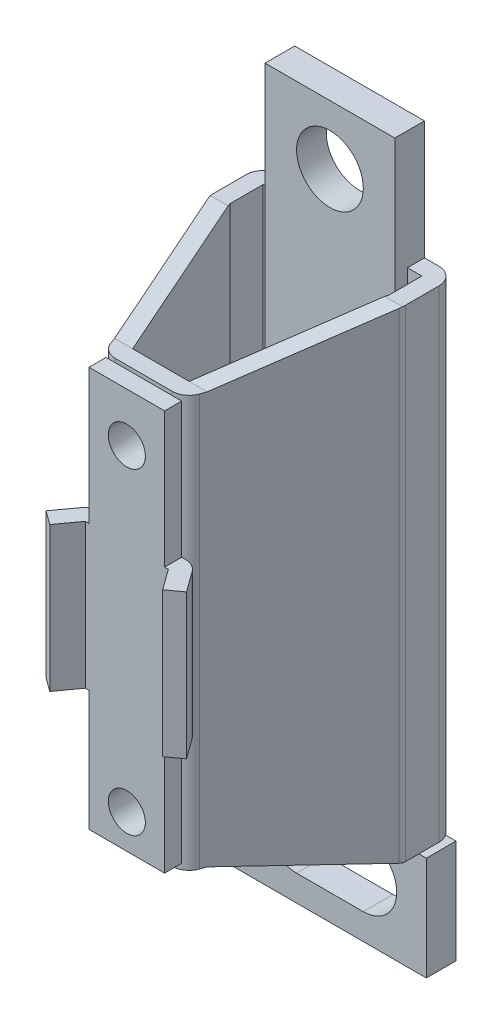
ISO-10303-21;
HEADER;
FILE_DESCRIPTION(('STEP AP214'),'2;1');
FILE_NAME('part.step','',(''),(''),'','','');
FILE_SCHEMA(('AUTOMOTIVE_DESIGN { 1 0 10303 214 1 1 1 1 }'));
ENDSEC;
DATA;
#1=APPLICATION_CONTEXT('core data for automotive mechanical design processes');
#2=APPLICATION_PROTOCOL_DEFINITION('international standard','automotive_design',2000,#1);
#3=PRODUCT_CONTEXT('',#1,'mechanical');
#4=PRODUCT('Part','Part','',(#3));
#5=PRODUCT_RELATED_PRODUCT_CATEGORY('part','',(#4));
#6=PRODUCT_DEFINITION_FORMATION('','',#4);
#7=PRODUCT_DEFINITION_CONTEXT('part definition',#1,'design');
#8=PRODUCT_DEFINITION('design','',#6,#7);
#9=PRODUCT_DEFINITION_SHAPE('','',#8);
#10=(LENGTH_UNIT() NAMED_UNIT(*) SI_UNIT(.MILLI.,.METRE.));
#11=(NAMED_UNIT(*) PLANE_ANGLE_UNIT() SI_UNIT($,.RADIAN.));
#12=(NAMED_UNIT(*) SI_UNIT($,.STERADIAN.) SOLID_ANGLE_UNIT());
#13=UNCERTAINTY_MEASURE_WITH_UNIT(LENGTH_MEASURE(1.E-05),#10,'distance_accuracy_value','');
#14=(GEOMETRIC_REPRESENTATION_CONTEXT(3) GLOBAL_UNCERTAINTY_ASSIGNED_CONTEXT((#13)) GLOBAL_UNIT_ASSIGNED_CONTEXT((#10,
#11,#12)) REPRESENTATION_CONTEXT('',''));
#15=CARTESIAN_POINT('',(0.,0.,0.));
#16=DIRECTION('',(0.,0.,1.));
#17=DIRECTION('',(1.,0.,0.));
#18=AXIS2_PLACEMENT_3D('',#15,#16,#17);
#19=CARTESIAN_POINT('',(-3.80942594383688,32.,-4.6));
#20=DIRECTION('',(0.,1.,0.));
#21=DIRECTION('',(0.,0.,1.));
#22=AXIS2_PLACEMENT_3D('',#19,#20,#21);
#23=PLANE('',#22);
#24=DIRECTION('',(0.,0.,1.));
#25=VECTOR('',#24,1.);
#26=CARTESIAN_POINT('',(-8.75,32.,-4.6));
#27=LINE('',#26,#25);
#28=CARTESIAN_POINT('',(-8.75,32.,-31.4));
#29=VERTEX_POINT('',#28);
#30=CARTESIAN_POINT('',(-8.75,32.,-29.1));
#31=VERTEX_POINT('',#30);
#32=EDGE_CURVE('E549',#29,#31,#27,.T.);
#33=ORIENTED_EDGE('',*,*,#32,.F.);
#34=DIRECTION('',(-1.,0.,0.));
#35=VECTOR('',#34,1.);
#36=CARTESIAN_POINT('',(13.,32.,-31.4));
#37=LINE('',#36,#35);
#38=CARTESIAN_POINT('',(-10.7,32.,-31.4));
#39=VERTEX_POINT('',#38);
#40=EDGE_CURVE('E1301',#29,#39,#37,.T.);
#41=ORIENTED_EDGE('',*,*,#40,.T.);
#42=CARTESIAN_POINT('',(-10.7,32.,-29.1));
#43=DIRECTION('',(0.,1.,0.));
#44=DIRECTION('',(0.,0.,1.));
#45=AXIS2_PLACEMENT_3D('',#42,#43,#44);
#46=CIRCLE('',#45,2.3);
#47=CARTESIAN_POINT('',(-13.,32.,-29.1));
#48=VERTEX_POINT('',#47);
#49=EDGE_CURVE('E1495',#39,#48,#46,.T.);
#50=ORIENTED_EDGE('',*,*,#49,.T.);
#51=DIRECTION('',(0.,0.,1.));
#52=VECTOR('',#51,1.);
#53=CARTESIAN_POINT('',(-13.,32.,-24.2267921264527));
#54=LINE('',#53,#52);
#55=CARTESIAN_POINT('',(-13.,32.,-24.6116801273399));
#56=VERTEX_POINT('',#55);
#57=EDGE_CURVE('E1305',#48,#56,#54,.T.);
#58=ORIENTED_EDGE('',*,*,#57,.T.);
#59=CARTESIAN_POINT('',(-10.7,32.,-24.6116801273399));
#60=DIRECTION('',(0.,1.,0.));
#61=DIRECTION('',(0.,0.,1.));
#62=AXIS2_PLACEMENT_3D('',#59,#60,#61);
#63=CIRCLE('',#62,2.3);
#64=CARTESIAN_POINT('',(-12.9675672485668,32.,-24.2267921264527));
#65=VERTEX_POINT('',#64);
#66=EDGE_CURVE('E1493',#56,#65,#63,.T.);
#67=ORIENTED_EDGE('',*,*,#66,.T.);
#68=DIRECTION('',(-1.,0.,0.));
#69=VECTOR('',#68,1.);
#70=CARTESIAN_POINT('',(102.140073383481,32.,-24.2267921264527));
#71=LINE('',#70,#69);
#72=CARTESIAN_POINT('',(-10.5674724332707,32.,-24.2267921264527));
#73=VERTEX_POINT('',#72);
#74=EDGE_CURVE('E1514',#73,#65,#71,.T.);
#75=ORIENTED_EDGE('',*,*,#74,.F.);
#76=DIRECTION('',(0.325568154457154,0.,0.945518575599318));
#77=VECTOR('',#76,1.);
#78=CARTESIAN_POINT('',(-3.80942594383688,32.,-4.6));
#79=LINE('',#78,#77);
#80=CARTESIAN_POINT('',(-10.7,32.,-24.6116801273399));
#81=VERTEX_POINT('',#80);
#82=EDGE_CURVE('E1262',#81,#73,#79,.T.);
#83=ORIENTED_EDGE('',*,*,#82,.F.);
#84=DIRECTION('',(0.,0.,1.));
#85=VECTOR('',#84,1.);
#86=CARTESIAN_POINT('',(-10.7,32.,-4.6));
#87=LINE('',#86,#85);
#88=CARTESIAN_POINT('',(-10.7,32.,-29.1));
#89=VERTEX_POINT('',#88);
#90=EDGE_CURVE('E1278',#89,#81,#87,.T.);
#91=ORIENTED_EDGE('',*,*,#90,.F.);
#92=DIRECTION('',(-1.,0.,0.));
#93=VECTOR('',#92,1.);
#94=CARTESIAN_POINT('',(-3.80942594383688,32.,-29.1));
#95=LINE('',#94,#93);
#96=EDGE_CURVE('E1274',#31,#89,#95,.T.);
#97=ORIENTED_EDGE('',*,*,#96,.F.);
#98=EDGE_LOOP('',(#33,#41,#50,#58,#67,#75,#83,#91,#97));
#99=FACE_BOUND('',#98,.T.);
#100=ADVANCED_FACE('F36',(#99),#23,.T.);
#101=CARTESIAN_POINT('',(-3.80942594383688,32.,-29.1));
#102=DIRECTION('',(0.,0.,1.));
#103=DIRECTION('',(1.,0.,0.));
#104=AXIS2_PLACEMENT_3D('',#101,#102,#103);
#105=PLANE('',#104);
#106=DIRECTION('',(0.,-1.,0.));
#107=VECTOR('',#106,1.);
#108=CARTESIAN_POINT('',(-8.75,32.,-29.1));
#109=LINE('',#108,#107);
#110=CARTESIAN_POINT('',(-8.74999999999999,-33.,-29.1));
#111=VERTEX_POINT('',#110);
#112=EDGE_CURVE('E547',#31,#111,#109,.T.);
#113=ORIENTED_EDGE('',*,*,#112,.F.);
#114=ORIENTED_EDGE('',*,*,#96,.T.);
#115=DIRECTION('',(0.,-1.,0.));
#116=VECTOR('',#115,1.);
#117=CARTESIAN_POINT('',(-10.7,32.,-29.1));
#118=LINE('',#117,#116);
#119=CARTESIAN_POINT('',(-10.7,-33.,-29.1));
#120=VERTEX_POINT('',#119);
#121=EDGE_CURVE('E1282',#89,#120,#118,.T.);
#122=ORIENTED_EDGE('',*,*,#121,.T.);
#123=DIRECTION('',(-1.,0.,0.));
#124=VECTOR('',#123,1.);
#125=CARTESIAN_POINT('',(-3.80942594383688,-33.,-29.1));
#126=LINE('',#125,#124);
#127=EDGE_CURVE('E1585',#111,#120,#126,.T.);
#128=ORIENTED_EDGE('',*,*,#127,.F.);
#129=EDGE_LOOP('',(#113,#114,#122,#128));
#130=FACE_BOUND('',#129,.T.);
#131=ADVANCED_FACE('F622',(#130),#105,.T.);
#132=CARTESIAN_POINT('',(-3.80942594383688,-33.,-4.6));
#133=DIRECTION('',(0.,1.,0.));
#134=DIRECTION('',(0.,0.,1.));
#135=AXIS2_PLACEMENT_3D('',#132,#133,#134);
#136=PLANE('',#135);
#137=DIRECTION('',(-1.,0.,0.));
#138=VECTOR('',#137,1.);
#139=CARTESIAN_POINT('',(13.,-33.,-31.4));
#140=LINE('',#139,#138);
#141=CARTESIAN_POINT('',(-8.74999999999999,-33.,-31.4));
#142=VERTEX_POINT('',#141);
#143=CARTESIAN_POINT('',(-10.7,-33.,-31.4));
#144=VERTEX_POINT('',#143);
#145=EDGE_CURVE('E1259',#142,#144,#140,.T.);
#146=ORIENTED_EDGE('',*,*,#145,.F.);
#147=DIRECTION('',(0.,0.,1.));
#148=VECTOR('',#147,1.);
#149=CARTESIAN_POINT('',(-8.74999999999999,-33.,-4.6));
#150=LINE('',#149,#148);
#151=EDGE_CURVE('E12',#142,#111,#150,.T.);
#152=ORIENTED_EDGE('',*,*,#151,.T.);
#153=ORIENTED_EDGE('',*,*,#127,.T.);
#154=DIRECTION('',(0.,0.,1.));
#155=VECTOR('',#154,1.);
#156=CARTESIAN_POINT('',(-10.7,-33.,-4.6));
#157=LINE('',#156,#155);
#158=CARTESIAN_POINT('',(-10.7,-33.,-24.6116801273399));
#159=VERTEX_POINT('',#158);
#160=EDGE_CURVE('E1586',#120,#159,#157,.T.);
#161=ORIENTED_EDGE('',*,*,#160,.T.);
#162=DIRECTION('',(0.325568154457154,0.,0.945518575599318));
#163=VECTOR('',#162,1.);
#164=CARTESIAN_POINT('',(-3.80942594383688,-33.,-4.6));
#165=LINE('',#164,#163);
#166=CARTESIAN_POINT('',(-10.5674724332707,-33.,-24.2267921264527));
#167=VERTEX_POINT('',#166);
#168=EDGE_CURVE('E1535',#159,#167,#165,.T.);
#169=ORIENTED_EDGE('',*,*,#168,.T.);
#170=DIRECTION('',(-1.,0.,0.));
#171=VECTOR('',#170,1.);
#172=CARTESIAN_POINT('',(102.140073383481,-33.,-24.2267921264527));
#173=LINE('',#172,#171);
#174=CARTESIAN_POINT('',(-12.9675672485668,-33.,-24.2267921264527));
#175=VERTEX_POINT('',#174);
#176=EDGE_CURVE('E1468',#167,#175,#173,.T.);
#177=ORIENTED_EDGE('',*,*,#176,.T.);
#178=CARTESIAN_POINT('',(-10.7,-33.,-24.6116801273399));
#179=DIRECTION('',(0.,1.,0.));
#180=DIRECTION('',(0.,0.,1.));
#181=AXIS2_PLACEMENT_3D('',#178,#179,#180);
#182=CIRCLE('',#181,2.3);
#183=CARTESIAN_POINT('',(-13.,-33.,-24.6116801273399));
#184=VERTEX_POINT('',#183);
#185=EDGE_CURVE('E1479',#175,#184,#182,.F.);
#186=ORIENTED_EDGE('',*,*,#185,.T.);
#187=DIRECTION('',(0.,0.,1.));
#188=VECTOR('',#187,1.);
#189=CARTESIAN_POINT('',(-13.,-33.,-24.2267921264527));
#190=LINE('',#189,#188);
#191=CARTESIAN_POINT('',(-13.,-33.,-29.1));
#192=VERTEX_POINT('',#191);
#193=EDGE_CURVE('E1258',#192,#184,#190,.T.);
#194=ORIENTED_EDGE('',*,*,#193,.F.);
#195=CARTESIAN_POINT('',(-10.7,-33.,-29.1));
#196=DIRECTION('',(0.,1.,0.));
#197=DIRECTION('',(0.,0.,1.));
#198=AXIS2_PLACEMENT_3D('',#195,#196,#197);
#199=CIRCLE('',#198,2.3);
#200=EDGE_CURVE('E1481',#192,#144,#199,.F.);
#201=ORIENTED_EDGE('',*,*,#200,.T.);
#202=EDGE_LOOP('',(#146,#152,#153,#161,#169,#177,#186,#194,#201));
#203=FACE_BOUND('',#202,.T.);
#204=ADVANCED_FACE('F627',(#203),#136,.F.);
#205=CARTESIAN_POINT('',(-3.80942594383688,32.,-4.6));
#206=DIRECTION('',(0.,-1.,0.));
#207=DIRECTION('',(0.,0.,-1.));
#208=AXIS2_PLACEMENT_3D('',#205,#206,#207);
#209=CYLINDRICAL_SURFACE('',#208,2.3);
#210=CARTESIAN_POINT('',(-3.80942594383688,22.6199483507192,-6.9));
#211=CARTESIAN_POINT('',(-3.77973041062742,22.7126777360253,-6.89999864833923));
#212=CARTESIAN_POINT('',(-3.74664947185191,22.804314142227,-6.89943113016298));
#213=CARTESIAN_POINT('',(-3.67388897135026,22.9849347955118,-6.89629207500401));
#214=CARTESIAN_POINT('',(-3.63420767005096,23.0739183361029,-6.89372000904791));
#215=CARTESIAN_POINT('',(-3.5485044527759,23.2486725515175,-6.88555745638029));
#216=CARTESIAN_POINT('',(-3.50248081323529,23.3344423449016,-6.8799661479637));
#217=CARTESIAN_POINT('',(-3.40448611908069,23.5021165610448,-6.86461522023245));
#218=CARTESIAN_POINT('',(-3.3525170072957,23.5840222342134,-6.85485695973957));
#219=CARTESIAN_POINT('',(-3.25576701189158,23.7249768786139,-6.83278383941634));
#220=CARTESIAN_POINT('',(-3.21208023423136,23.7849516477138,-6.82157246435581));
#221=CARTESIAN_POINT('',(-3.12188238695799,23.9018589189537,-6.79533364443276));
#222=CARTESIAN_POINT('',(-3.07537197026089,23.9587921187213,-6.78030707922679));
#223=CARTESIAN_POINT('',(-2.98005839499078,24.0691867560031,-6.74585902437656));
#224=CARTESIAN_POINT('',(-2.93125852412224,24.1226529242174,-6.72644369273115));
#225=CARTESIAN_POINT('',(-2.83194892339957,24.2258099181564,-6.68266354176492));
#226=CARTESIAN_POINT('',(-2.78143948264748,24.2755013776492,-6.65829955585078));
#227=CARTESIAN_POINT('',(-2.64487755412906,24.4030409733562,-6.58574522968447));
#228=CARTESIAN_POINT('',(-2.55789623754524,24.4771953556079,-6.53258667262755));
#229=CARTESIAN_POINT('',(-2.38572081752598,24.6125304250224,-6.40948743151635));
#230=CARTESIAN_POINT('',(-2.30052616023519,24.6737151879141,-6.33955203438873));
#231=CARTESIAN_POINT('',(-2.13675478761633,24.7829009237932,-6.18273730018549));
#232=CARTESIAN_POINT('',(-2.05820418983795,24.8308514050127,-6.09579517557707));
#233=CARTESIAN_POINT('',(-1.91311220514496,24.9138333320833,-5.90696860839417));
#234=CARTESIAN_POINT('',(-1.84657187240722,24.9488636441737,-5.80508285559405));
#235=CARTESIAN_POINT('',(-1.73352615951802,25.0053599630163,-5.59685589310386));
#236=CARTESIAN_POINT('',(-1.685965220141,25.0275870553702,-5.49129021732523));
#237=CARTESIAN_POINT('',(-1.60699510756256,25.0632573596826,-5.27289078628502));
#238=CARTESIAN_POINT('',(-1.57558566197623,25.0767007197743,-5.16005715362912));
#239=CARTESIAN_POINT('',(-1.53013541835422,25.0958494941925,-4.92969042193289));
#240=CARTESIAN_POINT('',(-1.51618765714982,25.1015134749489,-4.81213556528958));
#241=CARTESIAN_POINT('',(-1.50651921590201,25.1054591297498,-4.57614880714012));
#242=CARTESIAN_POINT('',(-1.51080013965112,25.1037401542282,-4.45771682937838));
#243=CARTESIAN_POINT('',(-1.5376005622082,25.0926950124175,-4.22172750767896));
#244=CARTESIAN_POINT('',(-1.5603555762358,25.0832706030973,-4.10420136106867));
#245=CARTESIAN_POINT('',(-1.62344659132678,25.055898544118,-3.87500628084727));
#246=CARTESIAN_POINT('',(-1.66378098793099,25.0379516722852,-3.76333681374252));
#247=CARTESIAN_POINT('',(-1.75982522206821,24.9924646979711,-3.54988963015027));
#248=CARTESIAN_POINT('',(-1.81542493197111,24.9649929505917,-3.44804787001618));
#249=CARTESIAN_POINT('',(-1.93926586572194,24.8991628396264,-3.25630410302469));
#250=CARTESIAN_POINT('',(-2.00750321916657,24.8608078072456,-3.16639845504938));
#251=CARTESIAN_POINT('',(-2.15174368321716,24.7729808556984,-3.00191293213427));
#252=CARTESIAN_POINT('',(-2.22761559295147,24.7236835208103,-2.92712422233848));
#253=CARTESIAN_POINT('',(-2.38378275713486,24.6135181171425,-2.79218285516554));
#254=CARTESIAN_POINT('',(-2.46407828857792,24.5526493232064,-2.73203111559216));
#255=CARTESIAN_POINT('',(-2.62801544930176,24.4174881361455,-2.62407667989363));
#256=CARTESIAN_POINT('',(-2.71166968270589,24.3427780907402,-2.57682140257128));
#257=CARTESIAN_POINT('',(-2.87555314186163,24.1828608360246,-2.49613566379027));
#258=CARTESIAN_POINT('',(-2.9557799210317,24.0976462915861,-2.46271493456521));
#259=CARTESIAN_POINT('',(-3.08951826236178,23.9421368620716,-2.41474000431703));
#260=CARTESIAN_POINT('',(-3.14448018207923,23.873863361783,-2.39753349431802));
#261=CARTESIAN_POINT('',(-3.25028857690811,23.7331037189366,-2.36832391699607));
#262=CARTESIAN_POINT('',(-3.30113339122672,23.6606158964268,-2.35632294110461));
#263=CARTESIAN_POINT('',(-3.39818354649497,23.5119294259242,-2.33652102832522));
#264=CARTESIAN_POINT('',(-3.44438252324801,23.4357258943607,-2.32872579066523));
#265=CARTESIAN_POINT('',(-3.53169843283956,23.2801768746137,-2.31640368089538));
#266=CARTESIAN_POINT('',(-3.57281328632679,23.2008301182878,-2.31187814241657));
#267=CARTESIAN_POINT('',(-3.65056760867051,23.0375958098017,-2.30515300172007));
#268=CARTESIAN_POINT('',(-3.68707981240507,22.9536454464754,-2.30301031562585));
#269=CARTESIAN_POINT('',(-3.75426942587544,22.78341456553,-2.30041565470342));
#270=CARTESIAN_POINT('',(-3.78494641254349,22.6971338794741,-2.29996380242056));
#271=CARTESIAN_POINT('',(-3.84030074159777,22.5227020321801,-2.30004064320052));
#272=CARTESIAN_POINT('',(-3.86498005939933,22.4345514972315,-2.30056901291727));
#273=CARTESIAN_POINT('',(-3.90823224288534,22.2567894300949,-2.30202162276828));
#274=CARTESIAN_POINT('',(-3.92680622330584,22.1671781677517,-2.30294579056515));
#275=CARTESIAN_POINT('',(-3.9609863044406,21.968145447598,-2.30492146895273));
#276=CARTESIAN_POINT('',(-3.97517350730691,21.8584771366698,-2.30595953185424));
#277=CARTESIAN_POINT('',(-3.99442244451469,21.6383301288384,-2.30743185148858));
#278=CARTESIAN_POINT('',(-3.99948312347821,21.5278513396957,-2.30786603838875));
#279=CARTESIAN_POINT('',(-4.00044197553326,21.3067668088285,-2.30794557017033));
#280=CARTESIAN_POINT('',(-3.9963330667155,21.1961610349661,-2.30759030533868));
#281=CARTESIAN_POINT('',(-3.97896721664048,20.9756786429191,-2.30624086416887));
#282=CARTESIAN_POINT('',(-3.9657105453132,20.865802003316,-2.30524670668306));
#283=CARTESIAN_POINT('',(-3.92986061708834,20.6458040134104,-2.30308404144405));
#284=CARTESIAN_POINT('',(-3.90712345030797,20.5357061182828,-2.30191303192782));
#285=CARTESIAN_POINT('',(-3.85246014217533,20.3177938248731,-2.30024023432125));
#286=CARTESIAN_POINT('',(-3.82053287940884,20.2099797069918,-2.29973852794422));
#287=CARTESIAN_POINT('',(-3.7477337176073,19.9974654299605,-2.30053961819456));
#288=CARTESIAN_POINT('',(-3.7068653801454,19.8927640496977,-2.30184169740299));
#289=CARTESIAN_POINT('',(-3.61650340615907,19.6872561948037,-2.30765835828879));
#290=CARTESIAN_POINT('',(-3.56701252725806,19.5864484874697,-2.31217191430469));
#291=CARTESIAN_POINT('',(-3.47355550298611,19.414707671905,-2.32430094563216));
#292=CARTESIAN_POINT('',(-3.43139715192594,19.3427098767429,-2.33083236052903));
#293=CARTESIAN_POINT('',(-3.34286393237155,19.2017776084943,-2.34736861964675));
#294=CARTESIAN_POINT('',(-3.29649006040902,19.1328424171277,-2.35737264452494));
#295=CARTESIAN_POINT('',(-3.19999748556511,18.9985764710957,-2.38165231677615));
#296=CARTESIAN_POINT('',(-3.14988471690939,18.9332402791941,-2.3959212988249));
#297=CARTESIAN_POINT('',(-3.04644580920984,18.8065731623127,-2.42955781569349));
#298=CARTESIAN_POINT('',(-2.99312040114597,18.7452413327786,-2.44892419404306));
#299=CARTESIAN_POINT('',(-2.85200320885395,18.5924607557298,-2.50665885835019));
#300=CARTESIAN_POINT('',(-2.76229683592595,18.5043813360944,-2.54951573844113));
#301=CARTESIAN_POINT('',(-2.58082134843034,18.3415370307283,-2.65285544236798));
#302=CARTESIAN_POINT('',(-2.48905338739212,18.2667648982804,-2.71332862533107));
#303=CARTESIAN_POINT('',(-2.35385056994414,18.1654008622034,-2.81825714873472));
#304=CARTESIAN_POINT('',(-2.30902857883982,18.1333126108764,-2.85576998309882));
#305=CARTESIAN_POINT('',(-2.22106768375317,18.0728851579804,-2.93547823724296));
#306=CARTESIAN_POINT('',(-2.17792804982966,18.0445443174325,-2.97767159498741));
#307=CARTESIAN_POINT('',(-2.09408421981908,17.9915876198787,-3.06659321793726));
#308=CARTESIAN_POINT('',(-2.05338039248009,17.9669723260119,-3.11332216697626));
#309=CARTESIAN_POINT('',(-1.97514843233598,17.9213740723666,-3.2109900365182));
#310=CARTESIAN_POINT('',(-1.93762002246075,17.9003907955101,-3.26192858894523));
#311=CARTESIAN_POINT('',(-1.83830052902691,17.8467056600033,-3.40936406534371));
#312=CARTESIAN_POINT('',(-1.78067977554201,17.8177905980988,-3.51014465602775));
#313=CARTESIAN_POINT('',(-1.68075849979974,17.7698280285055,-3.7211217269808));
#314=CARTESIAN_POINT('',(-1.63845731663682,17.7507800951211,-3.83131780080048));
#315=CARTESIAN_POINT('',(-1.57155936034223,17.7214785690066,-4.05636559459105));
#316=CARTESIAN_POINT('',(-1.54672375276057,17.7111059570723,-4.17113088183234));
#317=CARTESIAN_POINT('',(-1.51483211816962,17.6978944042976,-4.40352679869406));
#318=CARTESIAN_POINT('',(-1.50777711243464,17.6950558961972,-4.5211575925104));
#319=CARTESIAN_POINT('',(-1.51175506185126,17.6966767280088,-4.75797318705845));
#320=CARTESIAN_POINT('',(-1.52308222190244,17.7012547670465,-4.87715237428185));
#321=CARTESIAN_POINT('',(-1.56392734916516,17.7183406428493,-5.11177424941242));
#322=CARTESIAN_POINT('',(-1.59344555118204,17.7308485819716,-5.22721688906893));
#323=CARTESIAN_POINT('',(-1.66938118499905,17.764771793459,-5.45097284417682));
#324=CARTESIAN_POINT('',(-1.71579095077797,17.7861830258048,-5.5592893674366));
#325=CARTESIAN_POINT('',(-1.82327134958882,17.8392063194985,-5.76563814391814));
#326=CARTESIAN_POINT('',(-1.88433751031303,17.870815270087,-5.86367352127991));
#327=CARTESIAN_POINT('',(-2.016766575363,17.9448172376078,-6.04526624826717));
#328=CARTESIAN_POINT('',(-2.08794342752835,17.9870241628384,-6.12903536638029));
#329=CARTESIAN_POINT('',(-2.23738833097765,18.0830794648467,-6.28230783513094));
#330=CARTESIAN_POINT('',(-2.31565584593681,18.1369269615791,-6.35181226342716));
#331=CARTESIAN_POINT('',(-2.47601354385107,18.2568334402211,-6.47682949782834));
#332=CARTESIAN_POINT('',(-2.55813901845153,18.3230351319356,-6.53215874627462));
#333=CARTESIAN_POINT('',(-2.72126995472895,18.4663209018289,-6.62852387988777));
#334=CARTESIAN_POINT('',(-2.80227485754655,18.5434102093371,-6.66955286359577));
#335=CARTESIAN_POINT('',(-2.93592480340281,18.6821638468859,-6.72852084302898));
#336=CARTESIAN_POINT('',(-2.98971700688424,18.7414110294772,-6.74968850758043));
#337=CARTESIAN_POINT('',(-3.09439596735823,18.8640178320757,-6.78673587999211));
#338=CARTESIAN_POINT('',(-3.14528177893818,18.9273787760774,-6.80261387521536));
#339=CARTESIAN_POINT('',(-3.24358627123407,19.0578143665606,-6.82989554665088));
#340=CARTESIAN_POINT('',(-3.29099864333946,19.1248953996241,-6.84129123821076));
#341=CARTESIAN_POINT('',(-3.38182014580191,19.262226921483,-6.86037749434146));
#342=CARTESIAN_POINT('',(-3.4252283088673,19.3324781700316,-6.86806716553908));
#343=CARTESIAN_POINT('',(-3.51969240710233,19.4965458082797,-6.88231362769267));
#344=CARTESIAN_POINT('',(-3.56930692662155,19.5912794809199,-6.88789242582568));
#345=CARTESIAN_POINT('',(-3.66083613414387,19.7845372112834,-6.89565483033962));
#346=CARTESIAN_POINT('',(-3.70274866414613,19.8830623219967,-6.89783748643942));
#347=CARTESIAN_POINT('',(-3.7785658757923,20.083224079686,-6.90010591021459));
#348=CARTESIAN_POINT('',(-3.81246633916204,20.1848623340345,-6.90019057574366));
#349=CARTESIAN_POINT('',(-3.87200133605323,20.3905126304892,-6.89934141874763));
#350=CARTESIAN_POINT('',(-3.89763666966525,20.4945244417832,-6.8984076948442));
#351=CARTESIAN_POINT('',(-3.9407400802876,20.7055219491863,-6.8963511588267));
#352=CARTESIAN_POINT('',(-3.95810685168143,20.8125283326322,-6.89522621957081));
#353=CARTESIAN_POINT('',(-3.98410099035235,21.0276099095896,-6.89339458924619));
#354=CARTESIAN_POINT('',(-3.99272764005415,21.1356851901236,-6.89268793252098));
#355=CARTESIAN_POINT('',(-4.00117451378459,21.352019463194,-6.89199714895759));
#356=CARTESIAN_POINT('',(-4.0010080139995,21.4602779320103,-6.89201193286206));
#357=CARTESIAN_POINT('',(-3.99190480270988,21.6763891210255,-6.89275397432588));
#358=CARTESIAN_POINT('',(-3.98297051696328,21.7842419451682,-6.89348103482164));
#359=CARTESIAN_POINT('',(-3.95438700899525,22.0150683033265,-6.89547958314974));
#360=CARTESIAN_POINT('',(-3.93332466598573,22.1378683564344,-6.89681665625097));
#361=CARTESIAN_POINT('',(-3.87983134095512,22.3810246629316,-6.89907780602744));
#362=CARTESIAN_POINT('',(-3.84739611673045,22.5013799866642,-6.9000017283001));
#363=CARTESIAN_POINT('',(-3.80942594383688,22.6199483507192,-6.9));
#364=B_SPLINE_CURVE_WITH_KNOTS('',3,(#210,#211,#212,#213,#214,#215,#216,#217,#218,#219,#220,
#221,#222,#223,#224,#225,#226,#227,#228,#229,#230,#231,#232,#233,#234,#235,#236,#237,#238,#239,
#240,#241,#242,#243,#244,#245,#246,#247,#248,#249,#250,#251,#252,#253,#254,#255,#256,#257,#258,
#259,#260,#261,#262,#263,#264,#265,#266,#267,#268,#269,#270,#271,#272,#273,#274,#275,#276,#277,
#278,#279,#280,#281,#282,#283,#284,#285,#286,#287,#288,#289,#290,#291,#292,#293,#294,#295,#296,
#297,#298,#299,#300,#301,#302,#303,#304,#305,#306,#307,#308,#309,#310,#311,#312,#313,#314,#315,
#316,#317,#318,#319,#320,#321,#322,#323,#324,#325,#326,#327,#328,#329,#330,#331,#332,#333,#334,
#335,#336,#337,#338,#339,#340,#341,#342,#343,#344,#345,#346,#347,#348,#349,#350,#351,#352,#353,
#354,#355,#356,#357,#358,#359,#360,#361,#362,#363),.UNSPECIFIED.,.T.,.F.,(4,2,2,2,2,2,2,2,2,2,2,
2,2,2,2,2,2,2,2,2,2,2,2,2,2,2,2,2,2,2,2,2,2,2,2,2,2,2,2,2,2,2,2,2,2,2,2,2,2,2,2,2,2,2,2,2,2,2,2,
2,2,2,2,2,2,2,2,2,2,2,2,2,2,2,2,2,4),(0.,0.292020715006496,0.584118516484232,0.876295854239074,
1.1683779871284,1.39331212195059,1.61819444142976,1.84276315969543,2.06729408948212,
2.44372213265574,2.82003170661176,3.19775774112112,3.57551691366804,3.92755870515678,
4.27959455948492,4.63349820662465,4.98743299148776,5.34595208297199,5.70443845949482,
6.06040366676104,6.41626003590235,6.76680173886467,7.11736541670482,7.48106985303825,
7.845029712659,8.1126497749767,8.38037725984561,8.64846663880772,8.91666530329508,
9.19114100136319,9.46563659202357,9.74004165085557,10.0143965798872,10.3457658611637,
10.6771734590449,11.0088371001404,11.3404909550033,11.677373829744,12.0142978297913,
12.3510878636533,12.6877703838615,12.938625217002,13.1894209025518,13.4398266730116,
13.6901756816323,14.0869694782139,14.4835465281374,14.6833313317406,14.8830284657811,
15.0827557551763,15.2824655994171,15.6394681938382,15.996455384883,16.3484606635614,
16.7004861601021,17.058201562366,17.4159215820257,17.7734794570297,18.13092836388,
18.4824929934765,18.8340310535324,19.1899141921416,19.5459688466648,19.7939863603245,
20.042084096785,20.2906218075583,20.5392194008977,20.8600327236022,21.1809357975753,
21.502007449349,21.8230480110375,22.1479266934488,22.4728320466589,22.7972468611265,
23.1215719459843,23.4948246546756,23.8682167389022),.UNSPECIFIED.);
#365=CARTESIAN_POINT('',(-3.80942594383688,22.6199483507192,-2.3));
#366=VERTEX_POINT('',#365);
#367=CARTESIAN_POINT('',(-3.80942594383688,20.1800516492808,-2.3));
#368=VERTEX_POINT('',#367);
#369=EDGE_CURVE('E560',#366,#368,#364,.T.);
#370=ORIENTED_EDGE('',*,*,#369,.F.);
#371=DIRECTION('',(0.,-1.,0.));
#372=VECTOR('',#371,1.);
#373=CARTESIAN_POINT('',(-3.80942594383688,32.,-2.3));
#374=LINE('',#373,#372);
#375=CARTESIAN_POINT('',(-3.80942594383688,28.,-2.3));
#376=VERTEX_POINT('',#375);
#377=EDGE_CURVE('E1461',#366,#376,#374,.F.);
#378=ORIENTED_EDGE('',*,*,#377,.T.);
#379=DIRECTION('',(0.,-1.,0.));
#380=VECTOR('',#379,1.);
#381=CARTESIAN_POINT('',(-3.80942594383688,32.,-2.3));
#382=LINE('',#381,#380);
#383=CARTESIAN_POINT('',(-3.80942594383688,28.5,-2.3));
#384=VERTEX_POINT('',#383);
#385=EDGE_CURVE('E1318',#384,#376,#382,.T.);
#386=ORIENTED_EDGE('',*,*,#385,.F.);
#387=CARTESIAN_POINT('',(-3.80942594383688,28.5,-4.6));
#388=DIRECTION('',(0.,1.,0.));
#389=DIRECTION('',(0.,0.,1.));
#390=AXIS2_PLACEMENT_3D('',#387,#388,#389);
#391=CIRCLE('',#390,2.3);
#392=CARTESIAN_POINT('',(-5.98411866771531,28.5,-3.85119324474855));
#393=VERTEX_POINT('',#392);
#394=EDGE_CURVE('E1574',#393,#384,#391,.T.);
#395=ORIENTED_EDGE('',*,*,#394,.F.);
#396=DIRECTION('',(0.,-1.,0.));
#397=VECTOR('',#396,1.);
#398=CARTESIAN_POINT('',(-5.98411866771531,32.,-3.85119324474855));
#399=LINE('',#398,#397);
#400=CARTESIAN_POINT('',(-5.98411866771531,-27.,-3.85119324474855));
#401=VERTEX_POINT('',#400);
#402=EDGE_CURVE('E1308',#393,#401,#399,.T.);
#403=ORIENTED_EDGE('',*,*,#402,.T.);
#404=CARTESIAN_POINT('',(-3.80942594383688,-27.,-4.6));
#405=DIRECTION('',(0.,1.,0.));
#406=DIRECTION('',(0.,0.,1.));
#407=AXIS2_PLACEMENT_3D('',#404,#405,#406);
#408=CIRCLE('',#407,2.3);
#409=CARTESIAN_POINT('',(-3.80942594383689,-27.,-2.3));
#410=VERTEX_POINT('',#409);
#411=EDGE_CURVE('E1553',#401,#410,#408,.T.);
#412=ORIENTED_EDGE('',*,*,#411,.T.);
#413=CARTESIAN_POINT('',(-3.80942594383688,-26.,-2.3));
#414=VERTEX_POINT('',#413);
#415=EDGE_CURVE('E1317',#414,#410,#382,.T.);
#416=ORIENTED_EDGE('',*,*,#415,.F.);
#417=EDGE_CURVE('E1462',#414,#368,#374,.F.);
#418=ORIENTED_EDGE('',*,*,#417,.T.);
#419=EDGE_LOOP('',(#370,#378,#386,#395,#403,#412,#416,#418));
#420=FACE_BOUND('',#419,.T.);
#421=ADVANCED_FACE('F569',(#420),#209,.T.);
#422=CARTESIAN_POINT('',(3.80942594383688,32.,-4.6));
#423=DIRECTION('',(0.,-1.,0.));
#424=DIRECTION('',(0.,0.,-1.));
#425=AXIS2_PLACEMENT_3D('',#422,#423,#424);
#426=CYLINDRICAL_SURFACE('',#425,2.3);
#427=CARTESIAN_POINT('',(3.80942594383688,22.6199483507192,-6.9));
#428=CARTESIAN_POINT('',(3.83904143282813,22.5274699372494,-6.90000060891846));
#429=CARTESIAN_POINT('',(3.86528970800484,22.4339069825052,-6.89943480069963));
#430=CARTESIAN_POINT('',(3.910913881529,22.2450974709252,-6.89787315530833));
#431=CARTESIAN_POINT('',(3.93028759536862,22.1498503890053,-6.89687718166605));
#432=CARTESIAN_POINT('',(3.96207601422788,21.9580474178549,-6.8949842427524));
#433=CARTESIAN_POINT('',(3.97447990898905,21.8614897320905,-6.89408743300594));
#434=CARTESIAN_POINT('',(3.99221633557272,21.6677228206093,-6.89274200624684));
#435=CARTESIAN_POINT('',(3.99754856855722,21.5705135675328,-6.89229340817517));
#436=CARTESIAN_POINT('',(4.00138488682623,21.3609677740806,-6.89197745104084));
#437=CARTESIAN_POINT('',(3.99871068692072,21.248607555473,-6.89221026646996));
#438=CARTESIAN_POINT('',(3.98391970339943,21.0245034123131,-6.89338295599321));
#439=CARTESIAN_POINT('',(3.97180162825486,20.9127595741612,-6.89432292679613));
#440=CARTESIAN_POINT('',(3.93818947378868,20.6905613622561,-6.89645456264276));
#441=CARTESIAN_POINT('',(3.91668463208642,20.580108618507,-6.89764651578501));
#442=CARTESIAN_POINT('',(3.86444844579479,20.3614059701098,-6.89949007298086));
#443=CARTESIAN_POINT('',(3.83371748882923,20.25315597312,-6.90014169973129));
#444=CARTESIAN_POINT('',(3.76310923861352,20.0392109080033,-6.89980557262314));
#445=CARTESIAN_POINT('',(3.72319689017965,19.9335273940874,-6.89881144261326));
#446=CARTESIAN_POINT('',(3.63459287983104,19.7259424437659,-6.89377460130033));
#447=CARTESIAN_POINT('',(3.58589958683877,19.6240417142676,-6.88973132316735));
#448=CARTESIAN_POINT('',(3.48033395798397,19.4251792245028,-6.87695379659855));
#449=CARTESIAN_POINT('',(3.42348205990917,19.3282059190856,-6.86823112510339));
#450=CARTESIAN_POINT('',(3.30223784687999,19.1399709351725,-6.84423109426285));
#451=CARTESIAN_POINT('',(3.23785061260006,19.0487054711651,-6.82895813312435));
#452=CARTESIAN_POINT('',(3.12769897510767,18.905528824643,-6.79709130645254));
#453=CARTESIAN_POINT('',(3.08385725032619,18.8515493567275,-6.78307639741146));
#454=CARTESIAN_POINT('',(2.99404267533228,18.746611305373,-6.75114406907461));
#455=CARTESIAN_POINT('',(2.94807049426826,18.6956517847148,-6.73322786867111));
#456=CARTESIAN_POINT('',(2.85451005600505,18.5970749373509,-6.69301850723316));
#457=CARTESIAN_POINT('',(2.80692236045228,18.5494564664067,-6.67072685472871));
#458=CARTESIAN_POINT('',(2.71076818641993,18.4578678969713,-6.62135342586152));
#459=CARTESIAN_POINT('',(2.66220220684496,18.4138959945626,-6.59427403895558));
#460=CARTESIAN_POINT('',(2.56433180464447,18.3294264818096,-6.53469726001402));
#461=CARTESIAN_POINT('',(2.51502483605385,18.2889676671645,-6.50214878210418));
#462=CARTESIAN_POINT('',(2.41705133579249,18.2122527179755,-6.43164771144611));
#463=CARTESIAN_POINT('',(2.36838449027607,18.1759944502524,-6.39369788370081));
#464=CARTESIAN_POINT('',(2.27261146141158,18.1077829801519,-6.31235032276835));
#465=CARTESIAN_POINT('',(2.22550502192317,18.0758290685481,-6.26895348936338));
#466=CARTESIAN_POINT('',(2.13381931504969,18.0162434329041,-6.17688694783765));
#467=CARTESIAN_POINT('',(2.08923967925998,17.9886110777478,-6.12821801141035));
#468=CARTESIAN_POINT('',(1.97258609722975,17.919157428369,-5.98894409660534));
#469=CARTESIAN_POINT('',(1.90384058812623,17.8814546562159,-5.8933860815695));
#470=CARTESIAN_POINT('',(1.78065947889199,17.8175271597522,-5.69007269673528));
#471=CARTESIAN_POINT('',(1.72622289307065,17.7913016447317,-5.58231816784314));
#472=CARTESIAN_POINT('',(1.63673035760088,17.7498726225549,-5.36335089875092));
#473=CARTESIAN_POINT('',(1.60086522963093,17.7341978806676,-5.25255665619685));
#474=CARTESIAN_POINT('',(1.54622605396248,17.7108162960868,-5.02603367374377));
#475=CARTESIAN_POINT('',(1.52745176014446,17.7031093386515,-4.91030500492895));
#476=CARTESIAN_POINT('',(1.50759304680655,17.6949650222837,-4.6753317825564));
#477=CARTESIAN_POINT('',(1.50677859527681,17.6946386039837,-4.55606052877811));
#478=CARTESIAN_POINT('',(1.5235623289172,17.7015087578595,-4.31902850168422));
#479=CARTESIAN_POINT('',(1.54116211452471,17.708705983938,-4.20126786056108));
#480=CARTESIAN_POINT('',(1.59423347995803,17.731314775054,-3.96983943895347));
#481=CARTESIAN_POINT('',(1.62982019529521,17.7467792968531,-3.85620314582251));
#482=CARTESIAN_POINT('',(1.71732135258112,17.787090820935,-3.63719473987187));
#483=CARTESIAN_POINT('',(1.76923208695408,17.8119356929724,-3.5318207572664));
#484=CARTESIAN_POINT('',(1.88598379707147,17.8719278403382,-3.33374310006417));
#485=CARTESIAN_POINT('',(1.950641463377,17.9069320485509,-3.24088806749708));
#486=CARTESIAN_POINT('',(2.08981449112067,17.9883800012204,-3.06859596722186));
#487=CARTESIAN_POINT('',(2.16432777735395,18.0348213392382,-2.98915608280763));
#488=CARTESIAN_POINT('',(2.31862567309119,18.1392350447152,-2.84541063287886));
#489=CARTESIAN_POINT('',(2.39838005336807,18.1971446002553,-2.78102662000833));
#490=CARTESIAN_POINT('',(2.55931054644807,18.3242167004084,-2.66687788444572));
#491=CARTESIAN_POINT('',(2.64048698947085,18.393381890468,-2.61711660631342));
#492=CARTESIAN_POINT('',(2.80662757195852,18.5475216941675,-2.52781172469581));
#493=CARTESIAN_POINT('',(2.89141181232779,18.6332976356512,-2.48932977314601));
#494=CARTESIAN_POINT('',(3.05490823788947,18.8149477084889,-2.4255054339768));
#495=CARTESIAN_POINT('',(3.13361533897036,18.91083013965,-2.40017394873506));
#496=CARTESIAN_POINT('',(3.26533048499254,19.0876795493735,-2.36449646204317));
#497=CARTESIAN_POINT('',(3.3200705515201,19.1669630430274,-2.35203912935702));
#498=CARTESIAN_POINT('',(3.4239398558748,19.3297447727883,-2.3319169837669));
#499=CARTESIAN_POINT('',(3.47306664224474,19.4132448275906,-2.32425425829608));
#500=CARTESIAN_POINT('',(3.56528575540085,19.5839147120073,-2.31252096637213));
#501=CARTESIAN_POINT('',(3.60836806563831,19.6710903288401,-2.30845630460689));
#502=CARTESIAN_POINT('',(3.68808694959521,19.8483999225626,-2.30285540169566));
#503=CARTESIAN_POINT('',(3.72472415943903,19.9385336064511,-2.30131891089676));
#504=CARTESIAN_POINT('',(3.79204997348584,20.1231985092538,-2.29981376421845));
#505=CARTESIAN_POINT('',(3.82259417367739,20.2177825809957,-2.29987943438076));
#506=CARTESIAN_POINT('',(3.87655750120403,20.408956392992,-2.30082149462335));
#507=CARTESIAN_POINT('',(3.8999765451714,20.5055461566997,-2.30169789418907));
#508=CARTESIAN_POINT('',(3.93954640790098,20.7001264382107,-2.30359816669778));
#509=CARTESIAN_POINT('',(3.95570269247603,20.798115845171,-2.30462192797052));
#510=CARTESIAN_POINT('',(3.98068474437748,20.9950304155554,-2.3063508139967));
#511=CARTESIAN_POINT('',(3.98951012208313,21.0939556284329,-2.30705592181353));
#512=CARTESIAN_POINT('',(4.0004444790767,21.3050573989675,-2.3079376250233));
#513=CARTESIAN_POINT('',(4.00153392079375,21.4172885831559,-2.30803381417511));
#514=CARTESIAN_POINT('',(3.99428086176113,21.6414505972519,-2.30743796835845));
#515=CARTESIAN_POINT('',(3.98593745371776,21.7533813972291,-2.30674585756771));
#516=CARTESIAN_POINT('',(3.95985950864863,21.9763016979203,-2.30488766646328));
#517=CARTESIAN_POINT('',(3.94211160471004,22.0872896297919,-2.30372091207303));
#518=CARTESIAN_POINT('',(3.89734224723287,22.3073775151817,-2.30157183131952));
#519=CARTESIAN_POINT('',(3.87032107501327,22.4164775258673,-2.30058949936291));
#520=CARTESIAN_POINT('',(3.80707198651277,22.6324413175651,-2.29978302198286));
#521=CARTESIAN_POINT('',(3.77080893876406,22.7392948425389,-2.29996336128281));
#522=CARTESIAN_POINT('',(3.68938766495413,22.9495572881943,-2.30277348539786));
#523=CARTESIAN_POINT('',(3.64422793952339,23.0529656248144,-2.30540368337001));
#524=CARTESIAN_POINT('',(3.54550528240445,23.2552727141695,-2.31465557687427));
#525=CARTESIAN_POINT('',(3.49195868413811,23.3541797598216,-2.32126958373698));
#526=CARTESIAN_POINT('',(3.37700544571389,23.5467142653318,-2.3402649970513));
#527=CARTESIAN_POINT('',(3.31560343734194,23.6403447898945,-2.35264301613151));
#528=CARTESIAN_POINT('',(3.20850081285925,23.7897261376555,-2.37946333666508));
#529=CARTESIAN_POINT('',(3.16478304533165,23.8473090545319,-2.39168393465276));
#530=CARTESIAN_POINT('',(3.07479706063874,23.9594503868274,-2.4199667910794));
#531=CARTESIAN_POINT('',(3.02852957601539,24.0140096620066,-2.43602795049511));
#532=CARTESIAN_POINT('',(2.93397658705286,24.1197057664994,-2.47252487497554));
#533=CARTESIAN_POINT('',(2.88569366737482,24.1708467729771,-2.49295516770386));
#534=CARTESIAN_POINT('',(2.7876986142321,24.2694209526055,-2.53868941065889));
#535=CARTESIAN_POINT('',(2.73798667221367,24.3168546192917,-2.56399271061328));
#536=CARTESIAN_POINT('',(2.60273111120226,24.439564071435,-2.63954673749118));
#537=CARTESIAN_POINT('',(2.51647649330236,24.5110727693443,-2.6948582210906));
#538=CARTESIAN_POINT('',(2.34649756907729,24.6412089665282,-2.82205375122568));
#539=CARTESIAN_POINT('',(2.26277258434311,24.6998399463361,-2.89393330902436));
#540=CARTESIAN_POINT('',(2.10261837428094,24.8041411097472,-3.05414540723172));
#541=CARTESIAN_POINT('',(2.02621425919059,24.8497676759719,-3.14253170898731));
#542=CARTESIAN_POINT('',(1.88580565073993,24.9284914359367,-3.33361134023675));
#543=CARTESIAN_POINT('',(1.82180262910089,24.9615871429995,-3.43630636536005));
#544=CARTESIAN_POINT('',(1.7133657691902,25.0149438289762,-3.64624662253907));
#545=CARTESIAN_POINT('',(1.66797864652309,25.0358628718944,-3.75283546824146));
#546=CARTESIAN_POINT('',(1.59354068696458,25.069100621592,-3.97283315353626));
#547=CARTESIAN_POINT('',(1.56448969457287,25.0814194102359,-4.08624192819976));
#548=CARTESIAN_POINT('',(1.52377886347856,25.0984584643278,-4.31763268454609));
#549=CARTESIAN_POINT('',(1.51226061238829,25.1031168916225,-4.435644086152));
#550=CARTESIAN_POINT('',(1.50751645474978,25.1050506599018,-4.67210194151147));
#551=CARTESIAN_POINT('',(1.51429217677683,25.1023253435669,-4.79054843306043));
#552=CARTESIAN_POINT('',(1.54606371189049,25.0891712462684,-5.02598713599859));
#553=CARTESIAN_POINT('',(1.57127548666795,25.0786511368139,-5.14294524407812));
#554=CARTESIAN_POINT('',(1.63909092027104,25.0489369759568,-5.37054467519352));
#555=CARTESIAN_POINT('',(1.68169251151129,25.0297439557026,-5.48118674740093));
#556=CARTESIAN_POINT('',(1.78186290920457,24.981620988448,-5.69201175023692));
#557=CARTESIAN_POINT('',(1.83930313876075,24.9527740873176,-5.79227464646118));
#558=CARTESIAN_POINT('',(1.96633491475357,24.8840660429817,-5.98054486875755));
#559=CARTESIAN_POINT('',(2.03592305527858,24.8442079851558,-6.06855561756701));
#560=CARTESIAN_POINT('',(2.18234721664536,24.7533061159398,-6.22919303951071));
#561=CARTESIAN_POINT('',(2.25906979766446,24.70242448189,-6.30201548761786));
#562=CARTESIAN_POINT('',(2.41635773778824,24.5891375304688,-6.43298848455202));
#563=CARTESIAN_POINT('',(2.49692317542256,24.5267319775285,-6.49113873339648));
#564=CARTESIAN_POINT('',(2.6613986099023,24.3881463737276,-6.59548064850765));
#565=CARTESIAN_POINT('',(2.74530028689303,24.3114821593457,-6.6410358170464));
#566=CARTESIAN_POINT('',(2.90921142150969,24.147713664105,-6.71845546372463));
#567=CARTESIAN_POINT('',(2.98921667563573,24.0605984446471,-6.7503054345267));
#568=CARTESIAN_POINT('',(3.12282539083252,23.9011707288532,-6.79595214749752));
#569=CARTESIAN_POINT('',(3.17793230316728,23.8308027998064,-6.812284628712));
#570=CARTESIAN_POINT('',(3.28375153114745,23.6858318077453,-6.83978928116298));
#571=CARTESIAN_POINT('',(3.33446171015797,23.6112267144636,-6.85095895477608));
#572=CARTESIAN_POINT('',(3.4309174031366,23.4583921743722,-6.86917204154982));
#573=CARTESIAN_POINT('',(3.476661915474,23.3801620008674,-6.8762146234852));
#574=CARTESIAN_POINT('',(3.56279174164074,23.2206395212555,-6.88715010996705));
#575=CARTESIAN_POINT('',(3.60317907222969,23.1393483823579,-6.89104420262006));
#576=CARTESIAN_POINT('',(3.67310840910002,22.9856779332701,-6.89618562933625));
#577=CARTESIAN_POINT('',(3.70337739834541,22.9136371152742,-6.89772637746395));
#578=CARTESIAN_POINT('',(3.75962974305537,22.7679465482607,-6.89963290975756));
#579=CARTESIAN_POINT('',(3.78561606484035,22.6942979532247,-6.89999951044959));
#580=CARTESIAN_POINT('',(3.80942594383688,22.6199483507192,-6.9));
#581=B_SPLINE_CURVE_WITH_KNOTS('',3,(#427,#428,#429,#430,#431,#432,#433,#434,#435,#436,#437,
#438,#439,#440,#441,#442,#443,#444,#445,#446,#447,#448,#449,#450,#451,#452,#453,#454,#455,#456,
#457,#458,#459,#460,#461,#462,#463,#464,#465,#466,#467,#468,#469,#470,#471,#472,#473,#474,#475,
#476,#477,#478,#479,#480,#481,#482,#483,#484,#485,#486,#487,#488,#489,#490,#491,#492,#493,#494,
#495,#496,#497,#498,#499,#500,#501,#502,#503,#504,#505,#506,#507,#508,#509,#510,#511,#512,#513,
#514,#515,#516,#517,#518,#519,#520,#521,#522,#523,#524,#525,#526,#527,#528,#529,#530,#531,#532,
#533,#534,#535,#536,#537,#538,#539,#540,#541,#542,#543,#544,#545,#546,#547,#548,#549,#550,#551,
#552,#553,#554,#555,#556,#557,#558,#559,#560,#561,#562,#563,#564,#565,#566,#567,#568,#569,#570,
#571,#572,#573,#574,#575,#576,#577,#578,#579,#580),.UNSPECIFIED.,.T.,.F.,(4,2,2,2,2,2,2,2,2,2,2,
2,2,2,2,2,2,2,2,2,2,2,2,2,2,2,2,2,2,2,2,2,2,2,2,2,2,2,2,2,2,2,2,2,2,2,2,2,2,2,2,2,2,2,2,2,2,2,2,
2,2,2,2,2,2,2,2,2,2,2,2,2,2,2,2,2,4),(0.,0.291260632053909,0.582613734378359,0.874417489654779,
1.16623357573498,1.50299937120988,1.83981123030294,2.17701027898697,2.51419516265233,
2.85268946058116,3.19124669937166,3.52897017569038,3.86646724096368,4.07910767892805,
4.29168177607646,4.50418271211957,4.7165778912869,4.93108020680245,5.14547310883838,
5.35983064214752,5.57415684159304,5.94288112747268,6.31158000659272,6.66246842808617,
7.01335179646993,7.36950602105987,7.72569120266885,8.0841857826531,8.44259899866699,
8.79619138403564,9.14970943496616,9.50134228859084,9.8530579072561,10.2314581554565,
10.610171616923,10.9012404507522,11.1924359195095,11.4841083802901,11.7757520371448,
12.0736494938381,12.3715504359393,12.6692268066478,12.9669189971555,13.3032205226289,
13.6395543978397,13.9763676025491,14.3131705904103,14.6512734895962,14.989433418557,
15.3269427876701,15.6642540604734,15.8840450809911,16.103773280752,16.323227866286,
16.5426531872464,16.9157562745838,17.2887583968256,17.6629972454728,18.0372804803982,
18.3888049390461,18.7403260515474,19.0946711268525,19.4490477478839,19.807643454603,
20.1661965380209,20.5217412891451,20.8771865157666,21.2277201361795,21.5782609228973,
21.9441791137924,22.3104836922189,22.5827091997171,22.8550662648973,23.1274781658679,
23.3997872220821,23.634114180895,23.8682781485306),.UNSPECIFIED.);
#582=CARTESIAN_POINT('',(3.80942594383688,20.1800516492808,-2.3));
#583=VERTEX_POINT('',#582);
#584=CARTESIAN_POINT('',(3.80942594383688,22.6199483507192,-2.3));
#585=VERTEX_POINT('',#584);
#586=EDGE_CURVE('E587',#583,#585,#581,.T.);
#587=ORIENTED_EDGE('',*,*,#586,.F.);
#588=DIRECTION('',(0.,-1.,0.));
#589=VECTOR('',#588,1.);
#590=CARTESIAN_POINT('',(3.80942594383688,32.,-2.3));
#591=LINE('',#590,#589);
#592=CARTESIAN_POINT('',(3.80942594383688,-26.,-2.3));
#593=VERTEX_POINT('',#592);
#594=EDGE_CURVE('E1458',#593,#583,#591,.F.);
#595=ORIENTED_EDGE('',*,*,#594,.F.);
#596=DIRECTION('',(0.,-1.,0.));
#597=VECTOR('',#596,1.);
#598=CARTESIAN_POINT('',(3.80942594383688,32.,-2.3));
#599=LINE('',#598,#597);
#600=CARTESIAN_POINT('',(3.80942594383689,-27.,-2.3));
#601=VERTEX_POINT('',#600);
#602=EDGE_CURVE('E1313',#593,#601,#599,.T.);
#603=ORIENTED_EDGE('',*,*,#602,.T.);
#604=CARTESIAN_POINT('',(3.80942594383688,-27.,-4.6));
#605=DIRECTION('',(0.,1.,0.));
#606=DIRECTION('',(0.,0.,1.));
#607=AXIS2_PLACEMENT_3D('',#604,#605,#606);
#608=CIRCLE('',#607,2.3);
#609=CARTESIAN_POINT('',(5.98411866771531,-27.,-3.85119324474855));
#610=VERTEX_POINT('',#609);
#611=EDGE_CURVE('E1557',#601,#610,#608,.T.);
#612=ORIENTED_EDGE('',*,*,#611,.T.);
#613=DIRECTION('',(0.,-1.,0.));
#614=VECTOR('',#613,1.);
#615=CARTESIAN_POINT('',(5.98411866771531,32.,-3.85119324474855));
#616=LINE('',#615,#614);
#617=CARTESIAN_POINT('',(5.98411866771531,28.5,-3.85119324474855));
#618=VERTEX_POINT('',#617);
#619=EDGE_CURVE('E1311',#618,#610,#616,.T.);
#620=ORIENTED_EDGE('',*,*,#619,.F.);
#621=CARTESIAN_POINT('',(3.80942594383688,28.5,-4.6));
#622=DIRECTION('',(0.,1.,0.));
#623=DIRECTION('',(0.,0.,1.));
#624=AXIS2_PLACEMENT_3D('',#621,#622,#623);
#625=CIRCLE('',#624,2.3);
#626=CARTESIAN_POINT('',(3.80942594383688,28.5,-2.3));
#627=VERTEX_POINT('',#626);
#628=EDGE_CURVE('E1578',#627,#618,#625,.T.);
#629=ORIENTED_EDGE('',*,*,#628,.F.);
#630=CARTESIAN_POINT('',(3.80942594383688,28.,-2.3));
#631=VERTEX_POINT('',#630);
#632=EDGE_CURVE('E1314',#627,#631,#599,.T.);
#633=ORIENTED_EDGE('',*,*,#632,.T.);
#634=EDGE_CURVE('E1450',#585,#631,#591,.F.);
#635=ORIENTED_EDGE('',*,*,#634,.F.);
#636=EDGE_LOOP('',(#587,#595,#603,#612,#620,#629,#633,#635));
#637=FACE_BOUND('',#636,.T.);
#638=ADVANCED_FACE('F595',(#637),#426,.T.);
#639=CARTESIAN_POINT('',(-3.80942594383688,32.,-4.6));
#640=DIRECTION('',(0.945518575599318,0.,-0.325568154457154));
#641=DIRECTION('',(-0.325568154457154,0.,-0.945518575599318));
#642=AXIS2_PLACEMENT_3D('',#639,#640,#641);
#643=PLANE('',#642);
#644=DIRECTION('',(0.,-1.,0.));
#645=VECTOR('',#644,1.);
#646=CARTESIAN_POINT('',(-3.80942594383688,32.,-4.6));
#647=LINE('',#646,#645);
#648=CARTESIAN_POINT('',(-3.80942594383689,28.5,-4.6));
#649=VERTEX_POINT('',#648);
#650=CARTESIAN_POINT('',(-3.80942594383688,22.6199483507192,-4.6));
#651=VERTEX_POINT('',#650);
#652=EDGE_CURVE('E1295',#649,#651,#647,.T.);
#653=ORIENTED_EDGE('',*,*,#652,.T.);
#654=CARTESIAN_POINT('',(0.,21.4,6.46337626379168));
#655=DIRECTION('',(0.945518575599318,0.,-0.325568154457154));
#656=DIRECTION('',(0.325568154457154,0.,0.945518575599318));
#657=AXIS2_PLACEMENT_3D('',#654,#655,#656);
#658=ELLIPSE('',#657,12.2862139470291,4.);
#659=CARTESIAN_POINT('',(-3.80942594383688,20.1800516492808,-4.6));
#660=VERTEX_POINT('',#659);
#661=EDGE_CURVE('E1619',#651,#660,#658,.F.);
#662=ORIENTED_EDGE('',*,*,#661,.T.);
#663=CARTESIAN_POINT('',(-3.80942594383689,-27.,-4.6));
#664=VERTEX_POINT('',#663);
#665=EDGE_CURVE('E1294',#660,#664,#647,.T.);
#666=ORIENTED_EDGE('',*,*,#665,.T.);
#667=DIRECTION('',(0.312764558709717,0.277681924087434,0.908334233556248));
#668=VECTOR('',#667,1.);
#669=CARTESIAN_POINT('',(1.31466885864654,-22.4506721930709,10.2814518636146));
#670=LINE('',#669,#668);
#671=EDGE_CURVE('E1548',#167,#664,#670,.T.);
#672=ORIENTED_EDGE('',*,*,#671,.F.);
#673=ORIENTED_EDGE('',*,*,#168,.F.);
#674=DIRECTION('',(0.,-1.,0.));
#675=VECTOR('',#674,1.);
#676=CARTESIAN_POINT('',(-10.7,32.,-24.6116801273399));
#677=LINE('',#676,#675);
#678=EDGE_CURVE('E1280',#81,#159,#677,.T.);
#679=ORIENTED_EDGE('',*,*,#678,.F.);
#680=ORIENTED_EDGE('',*,*,#82,.T.);
#681=DIRECTION('',(0.321036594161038,-0.16626521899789,0.932357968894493));
#682=VECTOR('',#681,1.);
#683=CARTESIAN_POINT('',(-3.99624621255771,28.5967544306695,-5.14256545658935));
#684=LINE('',#683,#682);
#685=EDGE_CURVE('E1522',#73,#649,#684,.T.);
#686=ORIENTED_EDGE('',*,*,#685,.T.);
#687=EDGE_LOOP('',(#653,#662,#666,#672,#673,#679,#680,#686));
#688=FACE_BOUND('',#687,.T.);
#689=ADVANCED_FACE('F599',(#688),#643,.T.);
#690=CARTESIAN_POINT('',(-3.80942594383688,32.,-4.6));
#691=DIRECTION('',(0.,0.,-1.));
#692=DIRECTION('',(-1.,0.,0.));
#693=AXIS2_PLACEMENT_3D('',#690,#691,#692);
#694=PLANE('',#693);
#695=CARTESIAN_POINT('',(0.,-21.4,-4.6));
#696=DIRECTION('',(0.,0.,-1.));
#697=DIRECTION('',(-1.,0.,0.));
#698=AXIS2_PLACEMENT_3D('',#695,#696,#697);
#699=CIRCLE('',#698,2.5);
#700=CARTESIAN_POINT('',(-2.5,-21.4,-4.6));
#701=VERTEX_POINT('',#700);
#702=EDGE_CURVE('E1648',#701,#701,#699,.F.);
#703=ORIENTED_EDGE('',*,*,#702,.T.);
#704=EDGE_LOOP('',(#703));
#705=FACE_BOUND('',#704,.T.);
#706=ORIENTED_EDGE('',*,*,#665,.F.);
#707=CARTESIAN_POINT('',(0.,21.4,-4.6));
#708=DIRECTION('',(0.,0.,-1.));
#709=DIRECTION('',(-1.,0.,0.));
#710=AXIS2_PLACEMENT_3D('',#707,#708,#709);
#711=CIRCLE('',#710,4.);
#712=CARTESIAN_POINT('',(3.80942594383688,20.1800516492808,-4.6));
#713=VERTEX_POINT('',#712);
#714=EDGE_CURVE('E1645',#660,#713,#711,.F.);
#715=ORIENTED_EDGE('',*,*,#714,.T.);
#716=DIRECTION('',(0.,-1.,0.));
#717=VECTOR('',#716,1.);
#718=CARTESIAN_POINT('',(3.80942594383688,32.,-4.6));
#719=LINE('',#718,#717);
#720=CARTESIAN_POINT('',(3.80942594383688,-27.,-4.6));
#721=VERTEX_POINT('',#720);
#722=EDGE_CURVE('E1290',#713,#721,#719,.T.);
#723=ORIENTED_EDGE('',*,*,#722,.T.);
#724=DIRECTION('',(-1.,0.,0.));
#725=VECTOR('',#724,1.);
#726=CARTESIAN_POINT('',(102.140073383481,-27.,-4.6));
#727=LINE('',#726,#725);
#728=EDGE_CURVE('E1543',#721,#664,#727,.T.);
#729=ORIENTED_EDGE('',*,*,#728,.T.);
#730=EDGE_LOOP('',(#706,#715,#723,#729));
#731=FACE_BOUND('',#730,.T.);
#732=ADVANCED_FACE('F1004',(#705,#731),#694,.T.);
#733=CARTESIAN_POINT('',(3.80942594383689,28.5,-4.6));
#734=VERTEX_POINT('',#733);
#735=CARTESIAN_POINT('',(3.80942594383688,22.6199483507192,-4.6));
#736=VERTEX_POINT('',#735);
#737=EDGE_CURVE('E1291',#734,#736,#719,.T.);
#738=ORIENTED_EDGE('',*,*,#737,.T.);
#739=EDGE_CURVE('E1617',#736,#651,#711,.F.);
#740=ORIENTED_EDGE('',*,*,#739,.T.);
#741=ORIENTED_EDGE('',*,*,#652,.F.);
#742=DIRECTION('',(-1.,0.,0.));
#743=VECTOR('',#742,1.);
#744=CARTESIAN_POINT('',(102.140073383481,28.5,-4.6));
#745=LINE('',#744,#743);
#746=EDGE_CURVE('E1564',#734,#649,#745,.T.);
#747=ORIENTED_EDGE('',*,*,#746,.F.);
#748=EDGE_LOOP('',(#738,#740,#741,#747));
#749=FACE_BOUND('',#748,.T.);
#750=ADVANCED_FACE('F1012',(#749),#694,.T.);
#751=CARTESIAN_POINT('',(3.00186860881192,32.,-2.25468320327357));
#752=DIRECTION('',(-0.945518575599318,0.,-0.325568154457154));
#753=DIRECTION('',(-0.325568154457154,0.,0.945518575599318));
#754=AXIS2_PLACEMENT_3D('',#751,#752,#753);
#755=PLANE('',#754);
#756=ORIENTED_EDGE('',*,*,#722,.F.);
#757=CARTESIAN_POINT('',(0.,21.4,6.46337626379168));
#758=DIRECTION('',(-0.945518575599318,0.,-0.325568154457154));
#759=DIRECTION('',(-0.325568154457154,0.,0.945518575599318));
#760=AXIS2_PLACEMENT_3D('',#757,#758,#759);
#761=ELLIPSE('',#760,12.2862139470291,4.);
#762=EDGE_CURVE('E593',#713,#736,#761,.F.);
#763=ORIENTED_EDGE('',*,*,#762,.T.);
#764=ORIENTED_EDGE('',*,*,#737,.F.);
#765=DIRECTION('',(0.321036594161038,0.16626521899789,-0.932357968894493));
#766=VECTOR('',#765,1.);
#767=CARTESIAN_POINT('',(3.21101309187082,28.1900813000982,-2.86208288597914));
#768=LINE('',#767,#766);
#769=CARTESIAN_POINT('',(10.5674724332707,32.,-24.2267921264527));
#770=VERTEX_POINT('',#769);
#771=EDGE_CURVE('E1465',#734,#770,#768,.T.);
#772=ORIENTED_EDGE('',*,*,#771,.T.);
#773=DIRECTION('',(0.325568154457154,0.,-0.945518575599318));
#774=VECTOR('',#773,1.);
#775=CARTESIAN_POINT('',(3.00186860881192,32.,-2.25468320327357));
#776=LINE('',#775,#774);
#777=CARTESIAN_POINT('',(10.7,32.,-24.6116801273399));
#778=VERTEX_POINT('',#777);
#779=EDGE_CURVE('E1270',#770,#778,#776,.T.);
#780=ORIENTED_EDGE('',*,*,#779,.T.);
#781=DIRECTION('',(0.,-1.,0.));
#782=VECTOR('',#781,1.);
#783=CARTESIAN_POINT('',(10.7,32.,-24.6116801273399));
#784=LINE('',#783,#782);
#785=CARTESIAN_POINT('',(10.7,-33.,-24.6116801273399));
#786=VERTEX_POINT('',#785);
#787=EDGE_CURVE('E1287',#778,#786,#784,.T.);
#788=ORIENTED_EDGE('',*,*,#787,.T.);
#789=DIRECTION('',(0.325568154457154,0.,-0.945518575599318));
#790=VECTOR('',#789,1.);
#791=CARTESIAN_POINT('',(3.00186860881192,-33.,-2.25468320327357));
#792=LINE('',#791,#790);
#793=CARTESIAN_POINT('',(10.5674724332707,-33.,-24.2267921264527));
#794=VERTEX_POINT('',#793);
#795=EDGE_CURVE('E1581',#794,#786,#792,.T.);
#796=ORIENTED_EDGE('',*,*,#795,.F.);
#797=DIRECTION('',(0.312764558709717,-0.277681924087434,-0.908334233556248));
#798=VECTOR('',#797,1.);
#799=CARTESIAN_POINT('',(-2.05995766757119,-21.788982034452,12.4459277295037));
#800=LINE('',#799,#798);
#801=EDGE_CURVE('E1545',#721,#794,#800,.T.);
#802=ORIENTED_EDGE('',*,*,#801,.F.);
#803=EDGE_LOOP('',(#756,#763,#764,#772,#780,#788,#796,#802));
#804=FACE_BOUND('',#803,.T.);
#805=ADVANCED_FACE('F1020',(#804),#755,.T.);
#806=CARTESIAN_POINT('',(-5.1,28.,-2.3));
#807=DIRECTION('',(0.,0.,-1.));
#808=DIRECTION('',(-1.,0.,0.));
#809=AXIS2_PLACEMENT_3D('',#806,#807,#808);
#810=PLANE('',#809);
#811=ORIENTED_EDGE('',*,*,#594,.T.);
#812=CARTESIAN_POINT('',(0.,21.4,-2.3));
#813=DIRECTION('',(0.,0.,-1.));
#814=DIRECTION('',(-1.,0.,0.));
#815=AXIS2_PLACEMENT_3D('',#812,#813,#814);
#816=CIRCLE('',#815,4.);
#817=EDGE_CURVE('E567',#583,#585,#816,.F.);
#818=ORIENTED_EDGE('',*,*,#817,.T.);
#819=ORIENTED_EDGE('',*,*,#634,.T.);
#820=DIRECTION('',(-1.,0.,0.));
#821=VECTOR('',#820,1.);
#822=CARTESIAN_POINT('',(-5.1,28.,-2.3));
#823=LINE('',#822,#821);
#824=CARTESIAN_POINT('',(5.1,28.,-2.3));
#825=VERTEX_POINT('',#824);
#826=EDGE_CURVE('E1430',#825,#631,#823,.T.);
#827=ORIENTED_EDGE('',*,*,#826,.F.);
#828=DIRECTION('',(0.,1.,0.));
#829=VECTOR('',#828,1.);
#830=CARTESIAN_POINT('',(5.1,-26.,-2.3));
#831=LINE('',#830,#829);
#832=CARTESIAN_POINT('',(5.1,9.75,-2.3));
#833=VERTEX_POINT('',#832);
#834=EDGE_CURVE('E1424',#833,#825,#831,.T.);
#835=ORIENTED_EDGE('',*,*,#834,.F.);
#836=DIRECTION('',(-1.,0.,0.));
#837=VECTOR('',#836,1.);
#838=CARTESIAN_POINT('',(5.6,9.75,-2.3));
#839=LINE('',#838,#837);
#840=CARTESIAN_POINT('',(5.6,9.75,-2.3));
#841=VERTEX_POINT('',#840);
#842=EDGE_CURVE('E1382',#841,#833,#839,.T.);
#843=ORIENTED_EDGE('',*,*,#842,.F.);
#844=DIRECTION('',(0.,-1.,0.));
#845=VECTOR('',#844,1.);
#846=CARTESIAN_POINT('',(5.6,9.75,-2.3));
#847=LINE('',#846,#845);
#848=CARTESIAN_POINT('',(5.6,-9.75,-2.3));
#849=VERTEX_POINT('',#848);
#850=EDGE_CURVE('E1384',#841,#849,#847,.T.);
#851=ORIENTED_EDGE('',*,*,#850,.T.);
#852=DIRECTION('',(-1.,0.,0.));
#853=VECTOR('',#852,1.);
#854=CARTESIAN_POINT('',(5.6,-9.75,-2.3));
#855=LINE('',#854,#853);
#856=CARTESIAN_POINT('',(5.1,-9.75,-2.3));
#857=VERTEX_POINT('',#856);
#858=EDGE_CURVE('E1374',#849,#857,#855,.T.);
#859=ORIENTED_EDGE('',*,*,#858,.T.);
#860=CARTESIAN_POINT('',(5.1,-26.,-2.3));
#861=VERTEX_POINT('',#860);
#862=EDGE_CURVE('E1426',#861,#857,#831,.T.);
#863=ORIENTED_EDGE('',*,*,#862,.F.);
#864=DIRECTION('',(1.,0.,0.));
#865=VECTOR('',#864,1.);
#866=CARTESIAN_POINT('',(-5.1,-26.,-2.3));
#867=LINE('',#866,#865);
#868=EDGE_CURVE('E1419',#593,#861,#867,.T.);
#869=ORIENTED_EDGE('',*,*,#868,.F.);
#870=EDGE_LOOP('',(#811,#818,#819,#827,#835,#843,#851,#859,#863,#869));
#871=FACE_BOUND('',#870,.T.);
#872=ADVANCED_FACE('F1028',(#871),#810,.T.);
#873=ORIENTED_EDGE('',*,*,#377,.F.);
#874=CARTESIAN_POINT('',(0.,21.4,-2.3));
#875=DIRECTION('',(0.,0.,-1.));
#876=DIRECTION('',(-1.,0.,0.));
#877=AXIS2_PLACEMENT_3D('',#874,#875,#876);
#878=CIRCLE('',#877,4.);
#879=EDGE_CURVE('E557',#366,#368,#878,.F.);
#880=ORIENTED_EDGE('',*,*,#879,.T.);
#881=ORIENTED_EDGE('',*,*,#417,.F.);
#882=CARTESIAN_POINT('',(-5.1,-26.,-2.3));
#883=VERTEX_POINT('',#882);
#884=EDGE_CURVE('E1421',#883,#414,#867,.T.);
#885=ORIENTED_EDGE('',*,*,#884,.F.);
#886=DIRECTION('',(0.,-1.,0.));
#887=VECTOR('',#886,1.);
#888=CARTESIAN_POINT('',(-5.1,-26.,-2.3));
#889=LINE('',#888,#887);
#890=CARTESIAN_POINT('',(-5.1,-9.75,-2.3));
#891=VERTEX_POINT('',#890);
#892=EDGE_CURVE('E1420',#891,#883,#889,.T.);
#893=ORIENTED_EDGE('',*,*,#892,.F.);
#894=DIRECTION('',(1.,0.,0.));
#895=VECTOR('',#894,1.);
#896=CARTESIAN_POINT('',(-5.6,-9.75,-2.3));
#897=LINE('',#896,#895);
#898=CARTESIAN_POINT('',(-5.6,-9.75,-2.3));
#899=VERTEX_POINT('',#898);
#900=EDGE_CURVE('E1342',#899,#891,#897,.T.);
#901=ORIENTED_EDGE('',*,*,#900,.F.);
#902=DIRECTION('',(0.,-1.,0.));
#903=VECTOR('',#902,1.);
#904=CARTESIAN_POINT('',(-5.6,9.75,-2.3));
#905=LINE('',#904,#903);
#906=CARTESIAN_POINT('',(-5.6,9.75,-2.3));
#907=VERTEX_POINT('',#906);
#908=EDGE_CURVE('E1363',#907,#899,#905,.T.);
#909=ORIENTED_EDGE('',*,*,#908,.F.);
#910=DIRECTION('',(1.,0.,0.));
#911=VECTOR('',#910,1.);
#912=CARTESIAN_POINT('',(-5.6,9.75,-2.3));
#913=LINE('',#912,#911);
#914=CARTESIAN_POINT('',(-5.1,9.75,-2.3));
#915=VERTEX_POINT('',#914);
#916=EDGE_CURVE('E1324',#907,#915,#913,.T.);
#917=ORIENTED_EDGE('',*,*,#916,.T.);
#918=CARTESIAN_POINT('',(-5.1,28.,-2.3));
#919=VERTEX_POINT('',#918);
#920=EDGE_CURVE('E1416',#919,#915,#889,.T.);
#921=ORIENTED_EDGE('',*,*,#920,.F.);
#922=EDGE_CURVE('E1429',#376,#919,#823,.T.);
#923=ORIENTED_EDGE('',*,*,#922,.F.);
#924=EDGE_LOOP('',(#873,#880,#881,#885,#893,#901,#909,#917,#921,#923));
#925=FACE_BOUND('',#924,.T.);
#926=ADVANCED_FACE('F619',(#925),#810,.T.);
#927=CARTESIAN_POINT('',(-3.80942594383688,32.,-2.3));
#928=DIRECTION('',(0.,0.,-1.));
#929=DIRECTION('',(-1.,0.,0.));
#930=AXIS2_PLACEMENT_3D('',#927,#928,#929);
#931=PLANE('',#930);
#932=DIRECTION('',(-1.,0.,0.));
#933=VECTOR('',#932,1.);
#934=CARTESIAN_POINT('',(102.140073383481,28.5,-2.3));
#935=LINE('',#934,#933);
#936=EDGE_CURVE('E1566',#627,#384,#935,.T.);
#937=ORIENTED_EDGE('',*,*,#936,.T.);
#938=ORIENTED_EDGE('',*,*,#385,.T.);
#939=EDGE_CURVE('E1434',#631,#376,#823,.T.);
#940=ORIENTED_EDGE('',*,*,#939,.F.);
#941=ORIENTED_EDGE('',*,*,#632,.F.);
#942=EDGE_LOOP('',(#937,#938,#940,#941));
#943=FACE_BOUND('',#942,.T.);
#944=ADVANCED_FACE('F608',(#943),#931,.F.);
#945=CARTESIAN_POINT('',(5.98411866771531,32.,-3.85119324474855));
#946=DIRECTION('',(-0.945518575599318,0.,-0.325568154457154));
#947=DIRECTION('',(-0.325568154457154,0.,0.945518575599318));
#948=AXIS2_PLACEMENT_3D('',#945,#946,#947);
#949=PLANE('',#948);
#950=DIRECTION('',(0.312764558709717,-0.277681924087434,-0.908334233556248));
#951=VECTOR('',#950,1.);
#952=CARTESIAN_POINT('',(0.879904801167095,-22.2394094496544,10.9725201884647));
#953=LINE('',#952,#951);
#954=CARTESIAN_POINT('',(6.24195351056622,-27.,-4.6));
#955=VERTEX_POINT('',#954);
#956=CARTESIAN_POINT('',(12.8746927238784,-32.8887483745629,-23.8628733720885));
#957=VERTEX_POINT('',#956);
#958=EDGE_CURVE('E1221',#955,#957,#953,.T.);
#959=ORIENTED_EDGE('',*,*,#958,.T.);
#960=DIRECTION('',(0.,-1.,0.));
#961=VECTOR('',#960,1.);
#962=CARTESIAN_POINT('',(12.8746927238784,32.,-23.8628733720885));
#963=LINE('',#962,#961);
#964=CARTESIAN_POINT('',(12.8746927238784,31.935103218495,-23.8628733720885));
#965=VERTEX_POINT('',#964);
#966=EDGE_CURVE('E1224',#957,#965,#963,.F.);
#967=ORIENTED_EDGE('',*,*,#966,.T.);
#968=DIRECTION('',(0.321036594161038,0.16626521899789,-0.932357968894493));
#969=VECTOR('',#968,1.);
#970=CARTESIAN_POINT('',(6.17806655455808,28.4669128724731,-4.41445880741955));
#971=LINE('',#970,#969);
#972=CARTESIAN_POINT('',(6.24195351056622,28.5,-4.6));
#973=VERTEX_POINT('',#972);
#974=EDGE_CURVE('E1521',#973,#965,#971,.T.);
#975=ORIENTED_EDGE('',*,*,#974,.F.);
#976=DIRECTION('',(0.325568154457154,0.,-0.945518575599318));
#977=VECTOR('',#976,1.);
#978=CARTESIAN_POINT('',(5.98411866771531,28.5,-3.85119324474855));
#979=LINE('',#978,#977);
#980=EDGE_CURVE('E1576',#618,#973,#979,.T.);
#981=ORIENTED_EDGE('',*,*,#980,.F.);
#982=ORIENTED_EDGE('',*,*,#619,.T.);
#983=DIRECTION('',(0.325568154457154,0.,-0.945518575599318));
#984=VECTOR('',#983,1.);
#985=CARTESIAN_POINT('',(5.98411866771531,-27.,-3.85119324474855));
#986=LINE('',#985,#984);
#987=EDGE_CURVE('E1227',#610,#955,#986,.T.);
#988=ORIENTED_EDGE('',*,*,#987,.T.);
#989=EDGE_LOOP('',(#959,#967,#975,#981,#982,#988));
#990=FACE_BOUND('',#989,.T.);
#991=ADVANCED_FACE('F601',(#990),#949,.F.);
#992=CARTESIAN_POINT('',(-5.98411866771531,32.,-3.85119324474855));
#993=DIRECTION('',(0.945518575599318,0.,-0.325568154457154));
#994=DIRECTION('',(-0.325568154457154,0.,-0.945518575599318));
#995=AXIS2_PLACEMENT_3D('',#992,#993,#994);
#996=PLANE('',#995);
#997=DIRECTION('',(0.321036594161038,-0.16626521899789,0.932357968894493));
#998=VECTOR('',#997,1.);
#999=CARTESIAN_POINT('',(-6.17806655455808,28.4669128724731,-4.41445880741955));
#1000=LINE('',#999,#998);
#1001=CARTESIAN_POINT('',(-12.8746927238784,31.935103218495,-23.8628733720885));
#1002=VERTEX_POINT('',#1001);
#1003=CARTESIAN_POINT('',(-6.24195351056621,28.5,-4.6));
#1004=VERTEX_POINT('',#1003);
#1005=EDGE_CURVE('E1511',#1002,#1004,#1000,.T.);
#1006=ORIENTED_EDGE('',*,*,#1005,.F.);
#1007=DIRECTION('',(0.,-1.,0.));
#1008=VECTOR('',#1007,1.);
#1009=CARTESIAN_POINT('',(-12.8746927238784,32.,-23.8628733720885));
#1010=LINE('',#1009,#1008);
#1011=CARTESIAN_POINT('',(-12.8746927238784,-32.8887483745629,-23.8628733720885));
#1012=VERTEX_POINT('',#1011);
#1013=EDGE_CURVE('E1504',#1002,#1012,#1010,.T.);
#1014=ORIENTED_EDGE('',*,*,#1013,.T.);
#1015=DIRECTION('',(0.312764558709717,0.277681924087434,0.908334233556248));
#1016=VECTOR('',#1015,1.);
#1017=CARTESIAN_POINT('',(-0.879904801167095,-22.2394094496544,10.9725201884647));
#1018=LINE('',#1017,#1016);
#1019=CARTESIAN_POINT('',(-6.24195351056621,-27.,-4.6));
#1020=VERTEX_POINT('',#1019);
#1021=EDGE_CURVE('E1231',#1012,#1020,#1018,.T.);
#1022=ORIENTED_EDGE('',*,*,#1021,.T.);
#1023=DIRECTION('',(0.325568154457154,0.,0.945518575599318));
#1024=VECTOR('',#1023,1.);
#1025=CARTESIAN_POINT('',(-5.98411866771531,-27.,-3.85119324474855));
#1026=LINE('',#1025,#1024);
#1027=EDGE_CURVE('E1230',#1020,#401,#1026,.T.);
#1028=ORIENTED_EDGE('',*,*,#1027,.T.);
#1029=ORIENTED_EDGE('',*,*,#402,.F.);
#1030=DIRECTION('',(0.325568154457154,0.,0.945518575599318));
#1031=VECTOR('',#1030,1.);
#1032=CARTESIAN_POINT('',(-5.98411866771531,28.5,-3.85119324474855));
#1033=LINE('',#1032,#1031);
#1034=EDGE_CURVE('E1520',#1004,#393,#1033,.T.);
#1035=ORIENTED_EDGE('',*,*,#1034,.F.);
#1036=EDGE_LOOP('',(#1006,#1014,#1022,#1028,#1029,#1035));
#1037=FACE_BOUND('',#1036,.T.);
#1038=ADVANCED_FACE('F635',(#1037),#996,.F.);
#1039=CARTESIAN_POINT('',(-5.1,-26.,-2.3));
#1040=DIRECTION('',(-1.,0.,0.));
#1041=DIRECTION('',(0.,0.,1.));
#1042=AXIS2_PLACEMENT_3D('',#1039,#1040,#1041);
#1043=PLANE('',#1042);
#1044=DIRECTION('',(0.,-1.,0.));
#1045=VECTOR('',#1044,1.);
#1046=CARTESIAN_POINT('',(-5.1,-26.,0.));
#1047=LINE('',#1046,#1045);
#1048=CARTESIAN_POINT('',(-5.1,-9.75,0.));
#1049=VERTEX_POINT('',#1048);
#1050=CARTESIAN_POINT('',(-5.1,-26.,0.));
#1051=VERTEX_POINT('',#1050);
#1052=EDGE_CURVE('E1415',#1049,#1051,#1047,.T.);
#1053=ORIENTED_EDGE('',*,*,#1052,.F.);
#1054=DIRECTION('',(0.,0.,-1.));
#1055=VECTOR('',#1054,1.);
#1056=CARTESIAN_POINT('',(-5.1,-9.75,-2.3));
#1057=LINE('',#1056,#1055);
#1058=EDGE_CURVE('E1365',#1049,#891,#1057,.T.);
#1059=ORIENTED_EDGE('',*,*,#1058,.T.);
#1060=ORIENTED_EDGE('',*,*,#892,.T.);
#1061=DIRECTION('',(0.,0.,1.));
#1062=VECTOR('',#1061,1.);
#1063=CARTESIAN_POINT('',(-5.1,-26.,-2.3));
#1064=LINE('',#1063,#1062);
#1065=EDGE_CURVE('E1433',#883,#1051,#1064,.T.);
#1066=ORIENTED_EDGE('',*,*,#1065,.T.);
#1067=EDGE_LOOP('',(#1053,#1059,#1060,#1066));
#1068=FACE_BOUND('',#1067,.T.);
#1069=ADVANCED_FACE('F638',(#1068),#1043,.T.);
#1070=CARTESIAN_POINT('',(5.1,-26.,-2.3));
#1071=DIRECTION('',(1.,0.,0.));
#1072=DIRECTION('',(0.,1.,0.));
#1073=AXIS2_PLACEMENT_3D('',#1070,#1071,#1072);
#1074=PLANE('',#1073);
#1075=ORIENTED_EDGE('',*,*,#862,.T.);
#1076=DIRECTION('',(0.,0.,1.));
#1077=VECTOR('',#1076,1.);
#1078=CARTESIAN_POINT('',(5.1,-9.75,-2.3));
#1079=LINE('',#1078,#1077);
#1080=CARTESIAN_POINT('',(5.1,-9.75,0.));
#1081=VERTEX_POINT('',#1080);
#1082=EDGE_CURVE('E1410',#857,#1081,#1079,.T.);
#1083=ORIENTED_EDGE('',*,*,#1082,.T.);
#1084=DIRECTION('',(0.,1.,0.));
#1085=VECTOR('',#1084,1.);
#1086=CARTESIAN_POINT('',(5.1,-26.,0.));
#1087=LINE('',#1086,#1085);
#1088=CARTESIAN_POINT('',(5.1,-26.,0.));
#1089=VERTEX_POINT('',#1088);
#1090=EDGE_CURVE('E1442',#1089,#1081,#1087,.T.);
#1091=ORIENTED_EDGE('',*,*,#1090,.F.);
#1092=DIRECTION('',(0.,0.,1.));
#1093=VECTOR('',#1092,1.);
#1094=CARTESIAN_POINT('',(5.1,-26.,-2.3));
#1095=LINE('',#1094,#1093);
#1096=EDGE_CURVE('E1454',#861,#1089,#1095,.T.);
#1097=ORIENTED_EDGE('',*,*,#1096,.F.);
#1098=EDGE_LOOP('',(#1075,#1083,#1091,#1097));
#1099=FACE_BOUND('',#1098,.T.);
#1100=ADVANCED_FACE('F1692',(#1099),#1074,.T.);
#1101=DIRECTION('',(0.,0.,-1.));
#1102=VECTOR('',#1101,1.);
#1103=CARTESIAN_POINT('',(-5.1,9.75,-2.3));
#1104=LINE('',#1103,#1102);
#1105=CARTESIAN_POINT('',(-5.1,9.75,0.));
#1106=VERTEX_POINT('',#1105);
#1107=EDGE_CURVE('E1368',#1106,#915,#1104,.T.);
#1108=ORIENTED_EDGE('',*,*,#1107,.F.);
#1109=CARTESIAN_POINT('',(-5.1,28.,0.));
#1110=VERTEX_POINT('',#1109);
#1111=EDGE_CURVE('E1435',#1110,#1106,#1047,.T.);
#1112=ORIENTED_EDGE('',*,*,#1111,.F.);
#1113=DIRECTION('',(0.,0.,1.));
#1114=VECTOR('',#1113,1.);
#1115=CARTESIAN_POINT('',(-5.1,28.,-2.3));
#1116=LINE('',#1115,#1114);
#1117=EDGE_CURVE('E1448',#919,#1110,#1116,.T.);
#1118=ORIENTED_EDGE('',*,*,#1117,.F.);
#1119=ORIENTED_EDGE('',*,*,#920,.T.);
#1120=EDGE_LOOP('',(#1108,#1112,#1118,#1119));
#1121=FACE_BOUND('',#1120,.T.);
#1122=ADVANCED_FACE('F1665',(#1121),#1043,.T.);
#1123=CARTESIAN_POINT('',(-5.1,28.,-2.3));
#1124=DIRECTION('',(0.,1.,0.));
#1125=DIRECTION('',(0.,0.,1.));
#1126=AXIS2_PLACEMENT_3D('',#1123,#1124,#1125);
#1127=PLANE('',#1126);
#1128=DIRECTION('',(-1.,0.,0.));
#1129=VECTOR('',#1128,1.);
#1130=CARTESIAN_POINT('',(-5.1,28.,0.));
#1131=LINE('',#1130,#1129);
#1132=CARTESIAN_POINT('',(5.1,28.,0.));
#1133=VERTEX_POINT('',#1132);
#1134=EDGE_CURVE('E1445',#1133,#1110,#1131,.T.);
#1135=ORIENTED_EDGE('',*,*,#1134,.F.);
#1136=DIRECTION('',(0.,0.,1.));
#1137=VECTOR('',#1136,1.);
#1138=CARTESIAN_POINT('',(5.1,28.,-2.3));
#1139=LINE('',#1138,#1137);
#1140=EDGE_CURVE('E1451',#825,#1133,#1139,.T.);
#1141=ORIENTED_EDGE('',*,*,#1140,.F.);
#1142=ORIENTED_EDGE('',*,*,#826,.T.);
#1143=ORIENTED_EDGE('',*,*,#939,.T.);
#1144=ORIENTED_EDGE('',*,*,#922,.T.);
#1145=ORIENTED_EDGE('',*,*,#1117,.T.);
#1146=EDGE_LOOP('',(#1135,#1141,#1142,#1143,#1144,#1145));
#1147=FACE_BOUND('',#1146,.T.);
#1148=ADVANCED_FACE('F1717',(#1147),#1127,.T.);
#1149=DIRECTION('',(0.,0.,1.));
#1150=VECTOR('',#1149,1.);
#1151=CARTESIAN_POINT('',(5.1,9.75,-2.3));
#1152=LINE('',#1151,#1150);
#1153=CARTESIAN_POINT('',(5.1,9.75,0.));
#1154=VERTEX_POINT('',#1153);
#1155=EDGE_CURVE('E1413',#833,#1154,#1152,.T.);
#1156=ORIENTED_EDGE('',*,*,#1155,.F.);
#1157=ORIENTED_EDGE('',*,*,#834,.T.);
#1158=ORIENTED_EDGE('',*,*,#1140,.T.);
#1159=EDGE_CURVE('E1441',#1154,#1133,#1087,.T.);
#1160=ORIENTED_EDGE('',*,*,#1159,.F.);
#1161=EDGE_LOOP('',(#1156,#1157,#1158,#1160));
#1162=FACE_BOUND('',#1161,.T.);
#1163=ADVANCED_FACE('F1713',(#1162),#1074,.T.);
#1164=CARTESIAN_POINT('',(-5.1,-26.,-2.3));
#1165=DIRECTION('',(0.,-1.,0.));
#1166=DIRECTION('',(1.,0.,0.));
#1167=AXIS2_PLACEMENT_3D('',#1164,#1165,#1166);
#1168=PLANE('',#1167);
#1169=DIRECTION('',(1.,0.,0.));
#1170=VECTOR('',#1169,1.);
#1171=CARTESIAN_POINT('',(-5.1,-26.,0.));
#1172=LINE('',#1171,#1170);
#1173=EDGE_CURVE('E1438',#1051,#1089,#1172,.T.);
#1174=ORIENTED_EDGE('',*,*,#1173,.F.);
#1175=ORIENTED_EDGE('',*,*,#1065,.F.);
#1176=ORIENTED_EDGE('',*,*,#884,.T.);
#1177=EDGE_CURVE('E1425',#414,#593,#867,.T.);
#1178=ORIENTED_EDGE('',*,*,#1177,.T.);
#1179=ORIENTED_EDGE('',*,*,#868,.T.);
#1180=ORIENTED_EDGE('',*,*,#1096,.T.);
#1181=EDGE_LOOP('',(#1174,#1175,#1176,#1178,#1179,#1180));
#1182=FACE_BOUND('',#1181,.T.);
#1183=ADVANCED_FACE('F1058',(#1182),#1168,.T.);
#1184=CARTESIAN_POINT('',(-5.1,28.,0.));
#1185=DIRECTION('',(0.,0.,-1.));
#1186=DIRECTION('',(-1.,0.,0.));
#1187=AXIS2_PLACEMENT_3D('',#1184,#1185,#1186);
#1188=PLANE('',#1187);
#1189=CARTESIAN_POINT('',(0.,21.4,0.));
#1190=DIRECTION('',(0.,0.,1.));
#1191=DIRECTION('',(1.,0.,0.));
#1192=AXIS2_PLACEMENT_3D('',#1189,#1190,#1191);
#1193=CIRCLE('',#1192,2.5);
#1194=CARTESIAN_POINT('',(2.5,21.4,0.));
#1195=VERTEX_POINT('',#1194);
#1196=EDGE_CURVE('E1539',#1195,#1195,#1193,.T.);
#1197=ORIENTED_EDGE('',*,*,#1196,.F.);
#1198=EDGE_LOOP('',(#1197));
#1199=FACE_BOUND('',#1198,.T.);
#1200=ORIENTED_EDGE('',*,*,#1111,.T.);
#1201=DIRECTION('',(-1.,0.,0.));
#1202=VECTOR('',#1201,1.);
#1203=CARTESIAN_POINT('',(-5.6,9.75,0.));
#1204=LINE('',#1203,#1202);
#1205=CARTESIAN_POINT('',(-5.6,9.75,0.));
#1206=VERTEX_POINT('',#1205);
#1207=EDGE_CURVE('E1322',#1106,#1206,#1204,.T.);
#1208=ORIENTED_EDGE('',*,*,#1207,.T.);
#1209=DIRECTION('',(0.,-1.,0.));
#1210=VECTOR('',#1209,1.);
#1211=CARTESIAN_POINT('',(-5.6,9.75,0.));
#1212=LINE('',#1211,#1210);
#1213=CARTESIAN_POINT('',(-5.6,-9.75,0.));
#1214=VERTEX_POINT('',#1213);
#1215=EDGE_CURVE('E1340',#1206,#1214,#1212,.T.);
#1216=ORIENTED_EDGE('',*,*,#1215,.T.);
#1217=DIRECTION('',(-1.,0.,0.));
#1218=VECTOR('',#1217,1.);
#1219=CARTESIAN_POINT('',(-5.6,-9.75,0.));
#1220=LINE('',#1219,#1218);
#1221=EDGE_CURVE('E1321',#1049,#1214,#1220,.T.);
#1222=ORIENTED_EDGE('',*,*,#1221,.F.);
#1223=ORIENTED_EDGE('',*,*,#1052,.T.);
#1224=ORIENTED_EDGE('',*,*,#1173,.T.);
#1225=ORIENTED_EDGE('',*,*,#1090,.T.);
#1226=DIRECTION('',(1.,0.,0.));
#1227=VECTOR('',#1226,1.);
#1228=CARTESIAN_POINT('',(5.6,-9.75,0.));
#1229=LINE('',#1228,#1227);
#1230=CARTESIAN_POINT('',(5.6,-9.75,0.));
#1231=VERTEX_POINT('',#1230);
#1232=EDGE_CURVE('E1370',#1081,#1231,#1229,.T.);
#1233=ORIENTED_EDGE('',*,*,#1232,.T.);
#1234=DIRECTION('',(0.,-1.,0.));
#1235=VECTOR('',#1234,1.);
#1236=CARTESIAN_POINT('',(5.6,9.75,0.));
#1237=LINE('',#1236,#1235);
#1238=CARTESIAN_POINT('',(5.6,9.75,0.));
#1239=VERTEX_POINT('',#1238);
#1240=EDGE_CURVE('E1407',#1239,#1231,#1237,.T.);
#1241=ORIENTED_EDGE('',*,*,#1240,.F.);
#1242=DIRECTION('',(1.,0.,0.));
#1243=VECTOR('',#1242,1.);
#1244=CARTESIAN_POINT('',(5.6,9.75,0.));
#1245=LINE('',#1244,#1243);
#1246=EDGE_CURVE('E1371',#1154,#1239,#1245,.T.);
#1247=ORIENTED_EDGE('',*,*,#1246,.F.);
#1248=ORIENTED_EDGE('',*,*,#1159,.T.);
#1249=ORIENTED_EDGE('',*,*,#1134,.T.);
#1250=EDGE_LOOP('',(#1200,#1208,#1216,#1222,#1223,#1224,#1225,#1233,#1241,#1247,#1248,#1249));
#1251=FACE_BOUND('',#1250,.T.);
#1252=CARTESIAN_POINT('',(0.,-21.4,0.));
#1253=DIRECTION('',(0.,0.,1.));
#1254=DIRECTION('',(-1.,0.,0.));
#1255=AXIS2_PLACEMENT_3D('',#1252,#1253,#1254);
#1256=CIRCLE('',#1255,2.5);
#1257=CARTESIAN_POINT('',(-2.5,-21.4,0.));
#1258=VERTEX_POINT('',#1257);
#1259=EDGE_CURVE('E1650',#1258,#1258,#1256,.T.);
#1260=ORIENTED_EDGE('',*,*,#1259,.F.);
#1261=EDGE_LOOP('',(#1260));
#1262=FACE_BOUND('',#1261,.T.);
#1263=ADVANCED_FACE('F1053',(#1199,#1251,#1262),#1188,.F.);
#1264=CARTESIAN_POINT('',(5.6,9.75,0.));
#1265=DIRECTION('',(0.809016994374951,0.,-0.587785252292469));
#1266=DIRECTION('',(-0.587785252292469,0.,-0.809016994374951));
#1267=AXIS2_PLACEMENT_3D('',#1264,#1265,#1266);
#1268=PLANE('',#1267);
#1269=DIRECTION('',(0.587785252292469,0.,0.809016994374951));
#1270=VECTOR('',#1269,1.);
#1271=CARTESIAN_POINT('',(5.6,-9.75,0.));
#1272=LINE('',#1271,#1270);
#1273=CARTESIAN_POINT('',(7.61498160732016,-9.75,2.77338425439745));
#1274=VERTEX_POINT('',#1273);
#1275=EDGE_CURVE('E1386',#1231,#1274,#1272,.T.);
#1276=ORIENTED_EDGE('',*,*,#1275,.T.);
#1277=DIRECTION('',(0.,-1.,0.));
#1278=VECTOR('',#1277,1.);
#1279=CARTESIAN_POINT('',(7.61498160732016,9.75,2.77338425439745));
#1280=LINE('',#1279,#1278);
#1281=CARTESIAN_POINT('',(7.61498160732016,9.75,2.77338425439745));
#1282=VERTEX_POINT('',#1281);
#1283=EDGE_CURVE('E1404',#1282,#1274,#1280,.T.);
#1284=ORIENTED_EDGE('',*,*,#1283,.F.);
#1285=DIRECTION('',(0.587785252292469,0.,0.809016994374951));
#1286=VECTOR('',#1285,1.);
#1287=CARTESIAN_POINT('',(5.6,9.75,0.));
#1288=LINE('',#1287,#1286);
#1289=EDGE_CURVE('E1373',#1239,#1282,#1288,.T.);
#1290=ORIENTED_EDGE('',*,*,#1289,.F.);
#1291=ORIENTED_EDGE('',*,*,#1240,.T.);
#1292=EDGE_LOOP('',(#1276,#1284,#1290,#1291));
#1293=FACE_BOUND('',#1292,.T.);
#1294=ADVANCED_FACE('F1057',(#1293),#1268,.F.);
#1295=CARTESIAN_POINT('',(7.61498160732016,9.75,2.77338425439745));
#1296=DIRECTION('',(-0.587785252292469,0.,-0.809016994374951));
#1297=DIRECTION('',(-0.809016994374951,0.,0.587785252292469));
#1298=AXIS2_PLACEMENT_3D('',#1295,#1296,#1297);
#1299=PLANE('',#1298);
#1300=DIRECTION('',(0.809016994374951,0.,-0.587785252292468));
#1301=VECTOR('',#1300,1.);
#1302=CARTESIAN_POINT('',(7.61498160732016,-9.75,2.77338425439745));
#1303=LINE('',#1302,#1301);
#1304=CARTESIAN_POINT('',(9.47572069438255,-9.75,1.42147817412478));
#1305=VERTEX_POINT('',#1304);
#1306=EDGE_CURVE('E1388',#1274,#1305,#1303,.T.);
#1307=ORIENTED_EDGE('',*,*,#1306,.T.);
#1308=DIRECTION('',(0.,-1.,0.));
#1309=VECTOR('',#1308,1.);
#1310=CARTESIAN_POINT('',(9.47572069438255,9.75,1.42147817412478));
#1311=LINE('',#1310,#1309);
#1312=CARTESIAN_POINT('',(9.47572069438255,9.75,1.42147817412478));
#1313=VERTEX_POINT('',#1312);
#1314=EDGE_CURVE('E1401',#1313,#1305,#1311,.T.);
#1315=ORIENTED_EDGE('',*,*,#1314,.F.);
#1316=DIRECTION('',(0.809016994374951,0.,-0.587785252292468));
#1317=VECTOR('',#1316,1.);
#1318=CARTESIAN_POINT('',(7.61498160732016,9.75,2.77338425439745));
#1319=LINE('',#1318,#1317);
#1320=EDGE_CURVE('E1376',#1282,#1313,#1319,.T.);
#1321=ORIENTED_EDGE('',*,*,#1320,.F.);
#1322=ORIENTED_EDGE('',*,*,#1283,.T.);
#1323=EDGE_LOOP('',(#1307,#1315,#1321,#1322));
#1324=FACE_BOUND('',#1323,.T.);
#1325=ADVANCED_FACE('F1074',(#1324),#1299,.F.);
#1326=CARTESIAN_POINT('',(9.47572069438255,9.75,1.42147817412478));
#1327=DIRECTION('',(-0.809016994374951,0.,0.587785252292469));
#1328=DIRECTION('',(0.587785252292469,0.,0.809016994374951));
#1329=AXIS2_PLACEMENT_3D('',#1326,#1327,#1328);
#1330=PLANE('',#1329);
#1331=DIRECTION('',(-0.587785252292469,0.,-0.809016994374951));
#1332=VECTOR('',#1331,1.);
#1333=CARTESIAN_POINT('',(9.47572069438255,-9.75,1.42147817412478));
#1334=LINE('',#1333,#1332);
#1335=CARTESIAN_POINT('',(7.46073908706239,-9.75,-1.35190608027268));
#1336=VERTEX_POINT('',#1335);
#1337=EDGE_CURVE('E1390',#1305,#1336,#1334,.T.);
#1338=ORIENTED_EDGE('',*,*,#1337,.T.);
#1339=DIRECTION('',(0.,-1.,0.));
#1340=VECTOR('',#1339,1.);
#1341=CARTESIAN_POINT('',(7.46073908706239,9.75,-1.35190608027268));
#1342=LINE('',#1341,#1340);
#1343=CARTESIAN_POINT('',(7.46073908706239,9.75,-1.35190608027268));
#1344=VERTEX_POINT('',#1343);
#1345=EDGE_CURVE('E1398',#1344,#1336,#1342,.T.);
#1346=ORIENTED_EDGE('',*,*,#1345,.F.);
#1347=DIRECTION('',(-0.587785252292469,0.,-0.809016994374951));
#1348=VECTOR('',#1347,1.);
#1349=CARTESIAN_POINT('',(9.47572069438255,9.75,1.42147817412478));
#1350=LINE('',#1349,#1348);
#1351=EDGE_CURVE('E1378',#1313,#1344,#1350,.T.);
#1352=ORIENTED_EDGE('',*,*,#1351,.F.);
#1353=ORIENTED_EDGE('',*,*,#1314,.T.);
#1354=EDGE_LOOP('',(#1338,#1346,#1352,#1353));
#1355=FACE_BOUND('',#1354,.T.);
#1356=ADVANCED_FACE('F1083',(#1355),#1330,.F.);
#1357=CARTESIAN_POINT('',(5.6,9.75,0.));
#1358=DIRECTION('',(0.,-1.,0.));
#1359=DIRECTION('',(0.,0.,-1.));
#1360=AXIS2_PLACEMENT_3D('',#1357,#1358,#1359);
#1361=CYLINDRICAL_SURFACE('',#1360,2.3);
#1362=CARTESIAN_POINT('',(5.6,-9.75,0.));
#1363=DIRECTION('',(0.,1.,0.));
#1364=DIRECTION('',(0.,0.,1.));
#1365=AXIS2_PLACEMENT_3D('',#1362,#1363,#1364);
#1366=CIRCLE('',#1365,2.3);
#1367=EDGE_CURVE('E1392',#1336,#849,#1366,.T.);
#1368=ORIENTED_EDGE('',*,*,#1367,.T.);
#1369=ORIENTED_EDGE('',*,*,#850,.F.);
#1370=CARTESIAN_POINT('',(5.6,9.75,0.));
#1371=DIRECTION('',(0.,1.,0.));
#1372=DIRECTION('',(0.,0.,1.));
#1373=AXIS2_PLACEMENT_3D('',#1370,#1371,#1372);
#1374=CIRCLE('',#1373,2.3);
#1375=EDGE_CURVE('E1380',#1344,#841,#1374,.T.);
#1376=ORIENTED_EDGE('',*,*,#1375,.F.);
#1377=ORIENTED_EDGE('',*,*,#1345,.T.);
#1378=EDGE_LOOP('',(#1368,#1369,#1376,#1377));
#1379=FACE_BOUND('',#1378,.T.);
#1380=ADVANCED_FACE('F1091',(#1379),#1361,.T.);
#1381=CARTESIAN_POINT('',(5.6,9.75,0.));
#1382=DIRECTION('',(0.,1.,0.));
#1383=DIRECTION('',(0.,0.,1.));
#1384=AXIS2_PLACEMENT_3D('',#1381,#1382,#1383);
#1385=PLANE('',#1384);
#1386=ORIENTED_EDGE('',*,*,#842,.T.);
#1387=ORIENTED_EDGE('',*,*,#1155,.T.);
#1388=ORIENTED_EDGE('',*,*,#1246,.T.);
#1389=ORIENTED_EDGE('',*,*,#1289,.T.);
#1390=ORIENTED_EDGE('',*,*,#1320,.T.);
#1391=ORIENTED_EDGE('',*,*,#1351,.T.);
#1392=ORIENTED_EDGE('',*,*,#1375,.T.);
#1393=EDGE_LOOP('',(#1386,#1387,#1388,#1389,#1390,#1391,#1392));
#1394=FACE_BOUND('',#1393,.T.);
#1395=ADVANCED_FACE('F1099',(#1394),#1385,.T.);
#1396=CARTESIAN_POINT('',(5.6,-9.75,0.));
#1397=DIRECTION('',(0.,1.,0.));
#1398=DIRECTION('',(0.,0.,1.));
#1399=AXIS2_PLACEMENT_3D('',#1396,#1397,#1398);
#1400=PLANE('',#1399);
#1401=ORIENTED_EDGE('',*,*,#1082,.F.);
#1402=ORIENTED_EDGE('',*,*,#858,.F.);
#1403=ORIENTED_EDGE('',*,*,#1367,.F.);
#1404=ORIENTED_EDGE('',*,*,#1337,.F.);
#1405=ORIENTED_EDGE('',*,*,#1306,.F.);
#1406=ORIENTED_EDGE('',*,*,#1275,.F.);
#1407=ORIENTED_EDGE('',*,*,#1232,.F.);
#1408=EDGE_LOOP('',(#1401,#1402,#1403,#1404,#1405,#1406,#1407));
#1409=FACE_BOUND('',#1408,.T.);
#1410=ADVANCED_FACE('F1107',(#1409),#1400,.F.);
#1411=CARTESIAN_POINT('',(-5.6,9.75,0.));
#1412=DIRECTION('',(0.,-1.,0.));
#1413=DIRECTION('',(0.,0.,-1.));
#1414=AXIS2_PLACEMENT_3D('',#1411,#1412,#1413);
#1415=CYLINDRICAL_SURFACE('',#1414,2.3);
#1416=CARTESIAN_POINT('',(-5.6,-9.75,0.));
#1417=DIRECTION('',(0.,-1.,0.));
#1418=DIRECTION('',(0.,0.,1.));
#1419=AXIS2_PLACEMENT_3D('',#1416,#1417,#1418);
#1420=CIRCLE('',#1419,2.3);
#1421=CARTESIAN_POINT('',(-7.46073908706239,-9.75,-1.35190608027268));
#1422=VERTEX_POINT('',#1421);
#1423=EDGE_CURVE('E1344',#1422,#899,#1420,.T.);
#1424=ORIENTED_EDGE('',*,*,#1423,.F.);
#1425=DIRECTION('',(0.,-1.,0.));
#1426=VECTOR('',#1425,1.);
#1427=CARTESIAN_POINT('',(-7.46073908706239,9.75,-1.35190608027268));
#1428=LINE('',#1427,#1426);
#1429=CARTESIAN_POINT('',(-7.46073908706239,9.75,-1.35190608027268));
#1430=VERTEX_POINT('',#1429);
#1431=EDGE_CURVE('E1361',#1430,#1422,#1428,.T.);
#1432=ORIENTED_EDGE('',*,*,#1431,.F.);
#1433=CARTESIAN_POINT('',(-5.6,9.75,0.));
#1434=DIRECTION('',(0.,-1.,0.));
#1435=DIRECTION('',(0.,0.,1.));
#1436=AXIS2_PLACEMENT_3D('',#1433,#1434,#1435);
#1437=CIRCLE('',#1436,2.3);
#1438=EDGE_CURVE('E1328',#1430,#907,#1437,.T.);
#1439=ORIENTED_EDGE('',*,*,#1438,.T.);
#1440=ORIENTED_EDGE('',*,*,#908,.T.);
#1441=EDGE_LOOP('',(#1424,#1432,#1439,#1440));
#1442=FACE_BOUND('',#1441,.T.);
#1443=ADVANCED_FACE('F1115',(#1442),#1415,.T.);
#1444=CARTESIAN_POINT('',(-9.47572069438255,9.75,1.42147817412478));
#1445=DIRECTION('',(-0.809016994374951,0.,-0.587785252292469));
#1446=DIRECTION('',(-0.587785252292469,0.,0.809016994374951));
#1447=AXIS2_PLACEMENT_3D('',#1444,#1445,#1446);
#1448=PLANE('',#1447);
#1449=DIRECTION('',(0.587785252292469,0.,-0.809016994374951));
#1450=VECTOR('',#1449,1.);
#1451=CARTESIAN_POINT('',(-9.47572069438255,-9.75,1.42147817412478));
#1452=LINE('',#1451,#1450);
#1453=CARTESIAN_POINT('',(-9.47572069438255,-9.75,1.42147817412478));
#1454=VERTEX_POINT('',#1453);
#1455=EDGE_CURVE('E1347',#1454,#1422,#1452,.T.);
#1456=ORIENTED_EDGE('',*,*,#1455,.F.);
#1457=DIRECTION('',(0.,-1.,0.));
#1458=VECTOR('',#1457,1.);
#1459=CARTESIAN_POINT('',(-9.47572069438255,9.75,1.42147817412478));
#1460=LINE('',#1459,#1458);
#1461=CARTESIAN_POINT('',(-9.47572069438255,9.75,1.42147817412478));
#1462=VERTEX_POINT('',#1461);
#1463=EDGE_CURVE('E1359',#1462,#1454,#1460,.T.);
#1464=ORIENTED_EDGE('',*,*,#1463,.F.);
#1465=DIRECTION('',(0.587785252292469,0.,-0.809016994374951));
#1466=VECTOR('',#1465,1.);
#1467=CARTESIAN_POINT('',(-9.47572069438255,9.75,1.42147817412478));
#1468=LINE('',#1467,#1466);
#1469=EDGE_CURVE('E1331',#1462,#1430,#1468,.T.);
#1470=ORIENTED_EDGE('',*,*,#1469,.T.);
#1471=ORIENTED_EDGE('',*,*,#1431,.T.);
#1472=EDGE_LOOP('',(#1456,#1464,#1470,#1471));
#1473=FACE_BOUND('',#1472,.T.);
#1474=ADVANCED_FACE('F1124',(#1473),#1448,.T.);
#1475=CARTESIAN_POINT('',(-7.61498160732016,9.75,2.77338425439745));
#1476=DIRECTION('',(-0.587785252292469,0.,0.809016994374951));
#1477=DIRECTION('',(0.809016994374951,0.,0.587785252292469));
#1478=AXIS2_PLACEMENT_3D('',#1475,#1476,#1477);
#1479=PLANE('',#1478);
#1480=DIRECTION('',(-0.809016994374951,0.,-0.587785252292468));
#1481=VECTOR('',#1480,1.);
#1482=CARTESIAN_POINT('',(-7.61498160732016,-9.75,2.77338425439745));
#1483=LINE('',#1482,#1481);
#1484=CARTESIAN_POINT('',(-7.61498160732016,-9.75,2.77338425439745));
#1485=VERTEX_POINT('',#1484);
#1486=EDGE_CURVE('E1350',#1485,#1454,#1483,.T.);
#1487=ORIENTED_EDGE('',*,*,#1486,.F.);
#1488=DIRECTION('',(0.,-1.,0.));
#1489=VECTOR('',#1488,1.);
#1490=CARTESIAN_POINT('',(-7.61498160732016,9.75,2.77338425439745));
#1491=LINE('',#1490,#1489);
#1492=CARTESIAN_POINT('',(-7.61498160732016,9.75,2.77338425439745));
#1493=VERTEX_POINT('',#1492);
#1494=EDGE_CURVE('E1357',#1493,#1485,#1491,.T.);
#1495=ORIENTED_EDGE('',*,*,#1494,.F.);
#1496=DIRECTION('',(-0.809016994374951,0.,-0.587785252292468));
#1497=VECTOR('',#1496,1.);
#1498=CARTESIAN_POINT('',(-7.61498160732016,9.75,2.77338425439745));
#1499=LINE('',#1498,#1497);
#1500=EDGE_CURVE('E1334',#1493,#1462,#1499,.T.);
#1501=ORIENTED_EDGE('',*,*,#1500,.T.);
#1502=ORIENTED_EDGE('',*,*,#1463,.T.);
#1503=EDGE_LOOP('',(#1487,#1495,#1501,#1502));
#1504=FACE_BOUND('',#1503,.T.);
#1505=ADVANCED_FACE('F1132',(#1504),#1479,.T.);
#1506=CARTESIAN_POINT('',(-5.6,9.75,0.));
#1507=DIRECTION('',(0.809016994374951,0.,0.587785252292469));
#1508=DIRECTION('',(0.587785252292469,0.,-0.809016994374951));
#1509=AXIS2_PLACEMENT_3D('',#1506,#1507,#1508);
#1510=PLANE('',#1509);
#1511=DIRECTION('',(-0.587785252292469,0.,0.809016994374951));
#1512=VECTOR('',#1511,1.);
#1513=CARTESIAN_POINT('',(-5.6,-9.75,0.));
#1514=LINE('',#1513,#1512);
#1515=EDGE_CURVE('E1325',#1214,#1485,#1514,.T.);
#1516=ORIENTED_EDGE('',*,*,#1515,.F.);
#1517=ORIENTED_EDGE('',*,*,#1215,.F.);
#1518=DIRECTION('',(-0.587785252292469,0.,0.809016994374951));
#1519=VECTOR('',#1518,1.);
#1520=CARTESIAN_POINT('',(-5.6,9.75,0.));
#1521=LINE('',#1520,#1519);
#1522=EDGE_CURVE('E1337',#1206,#1493,#1521,.T.);
#1523=ORIENTED_EDGE('',*,*,#1522,.T.);
#1524=ORIENTED_EDGE('',*,*,#1494,.T.);
#1525=EDGE_LOOP('',(#1516,#1517,#1523,#1524));
#1526=FACE_BOUND('',#1525,.T.);
#1527=ADVANCED_FACE('F1140',(#1526),#1510,.T.);
#1528=CARTESIAN_POINT('',(-5.6,9.75,0.));
#1529=DIRECTION('',(0.,1.,0.));
#1530=DIRECTION('',(0.,0.,1.));
#1531=AXIS2_PLACEMENT_3D('',#1528,#1529,#1530);
#1532=PLANE('',#1531);
#1533=ORIENTED_EDGE('',*,*,#1207,.F.);
#1534=ORIENTED_EDGE('',*,*,#1107,.T.);
#1535=ORIENTED_EDGE('',*,*,#916,.F.);
#1536=ORIENTED_EDGE('',*,*,#1438,.F.);
#1537=ORIENTED_EDGE('',*,*,#1469,.F.);
#1538=ORIENTED_EDGE('',*,*,#1500,.F.);
#1539=ORIENTED_EDGE('',*,*,#1522,.F.);
#1540=EDGE_LOOP('',(#1533,#1534,#1535,#1536,#1537,#1538,#1539));
#1541=FACE_BOUND('',#1540,.T.);
#1542=ADVANCED_FACE('F1148',(#1541),#1532,.T.);
#1543=CARTESIAN_POINT('',(-5.6,-9.75,0.));
#1544=DIRECTION('',(0.,1.,0.));
#1545=DIRECTION('',(0.,0.,1.));
#1546=AXIS2_PLACEMENT_3D('',#1543,#1544,#1545);
#1547=PLANE('',#1546);
#1548=ORIENTED_EDGE('',*,*,#1058,.F.);
#1549=ORIENTED_EDGE('',*,*,#1221,.T.);
#1550=ORIENTED_EDGE('',*,*,#1515,.T.);
#1551=ORIENTED_EDGE('',*,*,#1486,.T.);
#1552=ORIENTED_EDGE('',*,*,#1455,.T.);
#1553=ORIENTED_EDGE('',*,*,#1423,.T.);
#1554=ORIENTED_EDGE('',*,*,#900,.T.);
#1555=EDGE_LOOP('',(#1548,#1549,#1550,#1551,#1552,#1553,#1554));
#1556=FACE_BOUND('',#1555,.T.);
#1557=ADVANCED_FACE('F614',(#1556),#1547,.F.);
#1558=DIRECTION('',(0.,0.,-1.));
#1559=VECTOR('',#1558,1.);
#1560=CARTESIAN_POINT('',(8.75,32.,-4.6));
#1561=LINE('',#1560,#1559);
#1562=CARTESIAN_POINT('',(8.75,32.,-29.1));
#1563=VERTEX_POINT('',#1562);
#1564=CARTESIAN_POINT('',(8.75,32.,-31.4));
#1565=VERTEX_POINT('',#1564);
#1566=EDGE_CURVE('E545',#1563,#1565,#1561,.T.);
#1567=ORIENTED_EDGE('',*,*,#1566,.F.);
#1568=CARTESIAN_POINT('',(10.7,32.,-29.1));
#1569=VERTEX_POINT('',#1568);
#1570=EDGE_CURVE('E1275',#1569,#1563,#95,.T.);
#1571=ORIENTED_EDGE('',*,*,#1570,.F.);
#1572=DIRECTION('',(0.,0.,-1.));
#1573=VECTOR('',#1572,1.);
#1574=CARTESIAN_POINT('',(10.7,32.,-4.6));
#1575=LINE('',#1574,#1573);
#1576=EDGE_CURVE('E1272',#778,#1569,#1575,.T.);
#1577=ORIENTED_EDGE('',*,*,#1576,.F.);
#1578=ORIENTED_EDGE('',*,*,#779,.F.);
#1579=CARTESIAN_POINT('',(12.9675672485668,32.,-24.2267921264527));
#1580=VERTEX_POINT('',#1579);
#1581=EDGE_CURVE('E1561',#1580,#770,#71,.T.);
#1582=ORIENTED_EDGE('',*,*,#1581,.F.);
#1583=CARTESIAN_POINT('',(10.7,32.,-24.6116801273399));
#1584=DIRECTION('',(0.,1.,0.));
#1585=DIRECTION('',(0.,0.,1.));
#1586=AXIS2_PLACEMENT_3D('',#1583,#1584,#1585);
#1587=CIRCLE('',#1586,2.3);
#1588=CARTESIAN_POINT('',(13.,32.,-24.6116801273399));
#1589=VERTEX_POINT('',#1588);
#1590=EDGE_CURVE('E1491',#1580,#1589,#1587,.T.);
#1591=ORIENTED_EDGE('',*,*,#1590,.T.);
#1592=DIRECTION('',(0.,0.,-1.));
#1593=VECTOR('',#1592,1.);
#1594=CARTESIAN_POINT('',(13.,32.,-24.2267921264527));
#1595=LINE('',#1594,#1593);
#1596=CARTESIAN_POINT('',(13.,32.,-29.1));
#1597=VERTEX_POINT('',#1596);
#1598=EDGE_CURVE('E1298',#1589,#1597,#1595,.T.);
#1599=ORIENTED_EDGE('',*,*,#1598,.T.);
#1600=CARTESIAN_POINT('',(10.7,32.,-29.1));
#1601=DIRECTION('',(0.,1.,0.));
#1602=DIRECTION('',(0.,0.,1.));
#1603=AXIS2_PLACEMENT_3D('',#1600,#1601,#1602);
#1604=CIRCLE('',#1603,2.3);
#1605=CARTESIAN_POINT('',(10.7,32.,-31.4));
#1606=VERTEX_POINT('',#1605);
#1607=EDGE_CURVE('E1497',#1597,#1606,#1604,.T.);
#1608=ORIENTED_EDGE('',*,*,#1607,.T.);
#1609=EDGE_CURVE('E1302',#1606,#1565,#37,.T.);
#1610=ORIENTED_EDGE('',*,*,#1609,.T.);
#1611=EDGE_LOOP('',(#1567,#1571,#1577,#1578,#1582,#1591,#1599,#1608,#1610));
#1612=FACE_BOUND('',#1611,.T.);
#1613=ADVANCED_FACE('F606',(#1612),#23,.T.);
#1614=ORIENTED_EDGE('',*,*,#415,.T.);
#1615=DIRECTION('',(1.,0.,0.));
#1616=VECTOR('',#1615,1.);
#1617=CARTESIAN_POINT('',(-3.80942594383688,-27.,-2.3));
#1618=LINE('',#1617,#1616);
#1619=EDGE_CURVE('E1469',#410,#601,#1618,.T.);
#1620=ORIENTED_EDGE('',*,*,#1619,.T.);
#1621=ORIENTED_EDGE('',*,*,#602,.F.);
#1622=ORIENTED_EDGE('',*,*,#1177,.F.);
#1623=EDGE_LOOP('',(#1614,#1620,#1621,#1622));
#1624=FACE_BOUND('',#1623,.T.);
#1625=ADVANCED_FACE('F603',(#1624),#931,.F.);
#1626=CARTESIAN_POINT('',(13.,32.,-24.2267921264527));
#1627=DIRECTION('',(-1.,0.,0.));
#1628=DIRECTION('',(0.,0.,1.));
#1629=AXIS2_PLACEMENT_3D('',#1626,#1627,#1628);
#1630=PLANE('',#1629);
#1631=DIRECTION('',(0.,0.,-1.));
#1632=VECTOR('',#1631,1.);
#1633=CARTESIAN_POINT('',(13.,-33.,-24.2267921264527));
#1634=LINE('',#1633,#1632);
#1635=CARTESIAN_POINT('',(13.,-33.,-24.6116801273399));
#1636=VERTEX_POINT('',#1635);
#1637=CARTESIAN_POINT('',(13.,-33.,-29.1));
#1638=VERTEX_POINT('',#1637);
#1639=EDGE_CURVE('E1264',#1636,#1638,#1634,.T.);
#1640=ORIENTED_EDGE('',*,*,#1639,.T.);
#1641=DIRECTION('',(0.,-1.,0.));
#1642=VECTOR('',#1641,1.);
#1643=CARTESIAN_POINT('',(13.,32.,-29.1));
#1644=LINE('',#1643,#1642);
#1645=EDGE_CURVE('E1489',#1638,#1597,#1644,.F.);
#1646=ORIENTED_EDGE('',*,*,#1645,.T.);
#1647=ORIENTED_EDGE('',*,*,#1598,.F.);
#1648=DIRECTION('',(0.,-1.,0.));
#1649=VECTOR('',#1648,1.);
#1650=CARTESIAN_POINT('',(13.,32.,-24.6116801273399));
#1651=LINE('',#1650,#1649);
#1652=EDGE_CURVE('E1486',#1589,#1636,#1651,.T.);
#1653=ORIENTED_EDGE('',*,*,#1652,.T.);
#1654=EDGE_LOOP('',(#1640,#1646,#1647,#1653));
#1655=FACE_BOUND('',#1654,.T.);
#1656=ADVANCED_FACE('F605',(#1655),#1630,.F.);
#1657=CARTESIAN_POINT('',(13.,32.,-31.4));
#1658=DIRECTION('',(0.,0.,1.));
#1659=DIRECTION('',(1.,0.,0.));
#1660=AXIS2_PLACEMENT_3D('',#1657,#1658,#1659);
#1661=PLANE('',#1660);
#1662=DIRECTION('',(1.,0.,0.));
#1663=VECTOR('',#1662,1.);
#1664=CARTESIAN_POINT('',(-4.5,-35.5,-31.4));
#1665=LINE('',#1664,#1663);
#1666=CARTESIAN_POINT('',(-4.5,-35.5,-31.4));
#1667=VERTEX_POINT('',#1666);
#1668=CARTESIAN_POINT('',(4.50000000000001,-35.5,-31.4));
#1669=VERTEX_POINT('',#1668);
#1670=EDGE_CURVE('E449',#1667,#1669,#1665,.T.);
#1671=ORIENTED_EDGE('',*,*,#1670,.F.);
#1672=CARTESIAN_POINT('',(-4.5,-40.,-31.4));
#1673=DIRECTION('',(0.,0.,1.));
#1674=DIRECTION('',(1.,0.,0.));
#1675=AXIS2_PLACEMENT_3D('',#1672,#1673,#1674);
#1676=CIRCLE('',#1675,4.5);
#1677=CARTESIAN_POINT('',(-4.5,-44.5,-31.4));
#1678=VERTEX_POINT('',#1677);
#1679=EDGE_CURVE('E444',#1667,#1678,#1676,.T.);
#1680=ORIENTED_EDGE('',*,*,#1679,.T.);
#1681=DIRECTION('',(-1.,0.,0.));
#1682=VECTOR('',#1681,1.);
#1683=CARTESIAN_POINT('',(4.50000000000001,-44.5,-31.4));
#1684=LINE('',#1683,#1682);
#1685=CARTESIAN_POINT('',(4.50000000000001,-44.5,-31.4));
#1686=VERTEX_POINT('',#1685);
#1687=EDGE_CURVE('E436',#1686,#1678,#1684,.T.);
#1688=ORIENTED_EDGE('',*,*,#1687,.F.);
#1689=CARTESIAN_POINT('',(4.5,-40.,-31.4));
#1690=DIRECTION('',(0.,0.,-1.));
#1691=DIRECTION('',(-1.,0.,0.));
#1692=AXIS2_PLACEMENT_3D('',#1689,#1690,#1691);
#1693=CIRCLE('',#1692,4.49999999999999);
#1694=EDGE_CURVE('E443',#1669,#1686,#1693,.T.);
#1695=ORIENTED_EDGE('',*,*,#1694,.F.);
#1696=EDGE_LOOP('',(#1671,#1680,#1688,#1695));
#1697=FACE_BOUND('',#1696,.T.);
#1698=CARTESIAN_POINT('',(0.,40.,-31.4));
#1699=DIRECTION('',(0.,0.,1.));
#1700=DIRECTION('',(1.,0.,0.));
#1701=AXIS2_PLACEMENT_3D('',#1698,#1699,#1700);
#1702=CIRCLE('',#1701,4.5);
#1703=CARTESIAN_POINT('',(4.5,40.,-31.4));
#1704=VERTEX_POINT('',#1703);
#1705=EDGE_CURVE('E472',#1704,#1704,#1702,.T.);
#1706=ORIENTED_EDGE('',*,*,#1705,.T.);
#1707=EDGE_LOOP('',(#1706));
#1708=FACE_BOUND('',#1707,.T.);
#1709=DIRECTION('',(0.,-1.,0.));
#1710=VECTOR('',#1709,1.);
#1711=CARTESIAN_POINT('',(8.75,48.,-31.4));
#1712=LINE('',#1711,#1710);
#1713=CARTESIAN_POINT('',(8.74999999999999,-33.,-31.4));
#1714=VERTEX_POINT('',#1713);
#1715=CARTESIAN_POINT('',(8.74999999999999,-34.,-31.4));
#1716=VERTEX_POINT('',#1715);
#1717=EDGE_CURVE('E533',#1714,#1716,#1712,.T.);
#1718=ORIENTED_EDGE('',*,*,#1717,.T.);
#1719=DIRECTION('',(1.,0.,0.));
#1720=VECTOR('',#1719,1.);
#1721=CARTESIAN_POINT('',(-13.,-34.,-31.4));
#1722=LINE('',#1721,#1720);
#1723=CARTESIAN_POINT('',(13.,-34.,-31.4));
#1724=VERTEX_POINT('',#1723);
#1725=EDGE_CURVE('E483',#1716,#1724,#1722,.T.);
#1726=ORIENTED_EDGE('',*,*,#1725,.T.);
#1727=DIRECTION('',(0.,-1.,0.));
#1728=VECTOR('',#1727,1.);
#1729=CARTESIAN_POINT('',(13.,-48.,-31.4));
#1730=LINE('',#1729,#1728);
#1731=CARTESIAN_POINT('',(13.,-48.,-31.4));
#1732=VERTEX_POINT('',#1731);
#1733=EDGE_CURVE('E480',#1724,#1732,#1730,.T.);
#1734=ORIENTED_EDGE('',*,*,#1733,.T.);
#1735=DIRECTION('',(-1.,0.,0.));
#1736=VECTOR('',#1735,1.);
#1737=CARTESIAN_POINT('',(-8.74999999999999,-48.,-31.4));
#1738=LINE('',#1737,#1736);
#1739=CARTESIAN_POINT('',(-13.,-48.,-31.4));
#1740=VERTEX_POINT('',#1739);
#1741=EDGE_CURVE('E517',#1732,#1740,#1738,.T.);
#1742=ORIENTED_EDGE('',*,*,#1741,.T.);
#1743=DIRECTION('',(0.,1.,0.));
#1744=VECTOR('',#1743,1.);
#1745=CARTESIAN_POINT('',(-13.,-48.,-31.4));
#1746=LINE('',#1745,#1744);
#1747=CARTESIAN_POINT('',(-13.,-34.,-31.4));
#1748=VERTEX_POINT('',#1747);
#1749=EDGE_CURVE('E487',#1740,#1748,#1746,.T.);
#1750=ORIENTED_EDGE('',*,*,#1749,.T.);
#1751=CARTESIAN_POINT('',(-8.74999999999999,-34.,-31.4));
#1752=VERTEX_POINT('',#1751);
#1753=EDGE_CURVE('E485',#1748,#1752,#1722,.T.);
#1754=ORIENTED_EDGE('',*,*,#1753,.T.);
#1755=DIRECTION('',(0.,1.,0.));
#1756=VECTOR('',#1755,1.);
#1757=CARTESIAN_POINT('',(-8.75,48.,-31.4));
#1758=LINE('',#1757,#1756);
#1759=EDGE_CURVE('E527',#1752,#142,#1758,.T.);
#1760=ORIENTED_EDGE('',*,*,#1759,.T.);
#1761=ORIENTED_EDGE('',*,*,#145,.T.);
#1762=DIRECTION('',(0.,-1.,0.));
#1763=VECTOR('',#1762,1.);
#1764=CARTESIAN_POINT('',(-10.7,32.,-31.4));
#1765=LINE('',#1764,#1763);
#1766=EDGE_CURVE('E1472',#144,#39,#1765,.F.);
#1767=ORIENTED_EDGE('',*,*,#1766,.T.);
#1768=ORIENTED_EDGE('',*,*,#40,.F.);
#1769=CARTESIAN_POINT('',(-8.75,48.,-31.4));
#1770=VERTEX_POINT('',#1769);
#1771=EDGE_CURVE('E513',#29,#1770,#1758,.T.);
#1772=ORIENTED_EDGE('',*,*,#1771,.T.);
#1773=DIRECTION('',(1.,0.,0.));
#1774=VECTOR('',#1773,1.);
#1775=CARTESIAN_POINT('',(-8.75,48.,-31.4));
#1776=LINE('',#1775,#1774);
#1777=CARTESIAN_POINT('',(8.75,48.,-31.4));
#1778=VERTEX_POINT('',#1777);
#1779=EDGE_CURVE('E529',#1770,#1778,#1776,.T.);
#1780=ORIENTED_EDGE('',*,*,#1779,.T.);
#1781=EDGE_CURVE('E534',#1778,#1565,#1712,.T.);
#1782=ORIENTED_EDGE('',*,*,#1781,.T.);
#1783=ORIENTED_EDGE('',*,*,#1609,.F.);
#1784=DIRECTION('',(0.,-1.,0.));
#1785=VECTOR('',#1784,1.);
#1786=CARTESIAN_POINT('',(10.7,32.,-31.4));
#1787=LINE('',#1786,#1785);
#1788=CARTESIAN_POINT('',(10.7,-33.,-31.4));
#1789=VERTEX_POINT('',#1788);
#1790=EDGE_CURVE('E1257',#1606,#1789,#1787,.T.);
#1791=ORIENTED_EDGE('',*,*,#1790,.T.);
#1792=EDGE_CURVE('E1247',#1789,#1714,#140,.T.);
#1793=ORIENTED_EDGE('',*,*,#1792,.T.);
#1794=EDGE_LOOP('',(#1718,#1726,#1734,#1742,#1750,#1754,#1760,#1761,#1767,#1768,#1772,#1780,
#1782,#1783,#1791,#1793));
#1795=FACE_BOUND('',#1794,.T.);
#1796=ADVANCED_FACE('F451',(#1697,#1708,#1795),#1661,.F.);
#1797=CARTESIAN_POINT('',(-13.,32.,-24.2267921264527));
#1798=DIRECTION('',(1.,0.,0.));
#1799=DIRECTION('',(0.,0.,-1.));
#1800=AXIS2_PLACEMENT_3D('',#1797,#1798,#1799);
#1801=PLANE('',#1800);
#1802=ORIENTED_EDGE('',*,*,#57,.F.);
#1803=DIRECTION('',(0.,-1.,0.));
#1804=VECTOR('',#1803,1.);
#1805=CARTESIAN_POINT('',(-13.,32.,-29.1));
#1806=LINE('',#1805,#1804);
#1807=EDGE_CURVE('E1501',#48,#192,#1806,.T.);
#1808=ORIENTED_EDGE('',*,*,#1807,.T.);
#1809=ORIENTED_EDGE('',*,*,#193,.T.);
#1810=DIRECTION('',(0.,-1.,0.));
#1811=VECTOR('',#1810,1.);
#1812=CARTESIAN_POINT('',(-13.,32.,-24.6116801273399));
#1813=LINE('',#1812,#1811);
#1814=EDGE_CURVE('E1499',#184,#56,#1813,.F.);
#1815=ORIENTED_EDGE('',*,*,#1814,.T.);
#1816=EDGE_LOOP('',(#1802,#1808,#1809,#1815));
#1817=FACE_BOUND('',#1816,.T.);
#1818=ADVANCED_FACE('F640',(#1817),#1801,.F.);
#1819=CARTESIAN_POINT('',(10.7,32.,-4.6));
#1820=DIRECTION('',(-1.,0.,0.));
#1821=DIRECTION('',(0.,0.,1.));
#1822=AXIS2_PLACEMENT_3D('',#1819,#1820,#1821);
#1823=PLANE('',#1822);
#1824=DIRECTION('',(0.,-1.,0.));
#1825=VECTOR('',#1824,1.);
#1826=CARTESIAN_POINT('',(10.7,32.,-29.1));
#1827=LINE('',#1826,#1825);
#1828=CARTESIAN_POINT('',(10.7,-33.,-29.1));
#1829=VERTEX_POINT('',#1828);
#1830=EDGE_CURVE('E1285',#1569,#1829,#1827,.T.);
#1831=ORIENTED_EDGE('',*,*,#1830,.T.);
#1832=DIRECTION('',(0.,0.,-1.));
#1833=VECTOR('',#1832,1.);
#1834=CARTESIAN_POINT('',(10.7,-33.,-4.6));
#1835=LINE('',#1834,#1833);
#1836=EDGE_CURVE('E1583',#786,#1829,#1835,.T.);
#1837=ORIENTED_EDGE('',*,*,#1836,.F.);
#1838=ORIENTED_EDGE('',*,*,#787,.F.);
#1839=ORIENTED_EDGE('',*,*,#1576,.T.);
#1840=EDGE_LOOP('',(#1831,#1837,#1838,#1839));
#1841=FACE_BOUND('',#1840,.T.);
#1842=ADVANCED_FACE('F643',(#1841),#1823,.T.);
#1843=DIRECTION('',(0.,1.,0.));
#1844=VECTOR('',#1843,1.);
#1845=CARTESIAN_POINT('',(8.75,32.,-29.1));
#1846=LINE('',#1845,#1844);
#1847=CARTESIAN_POINT('',(8.74999999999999,-33.,-29.1));
#1848=VERTEX_POINT('',#1847);
#1849=EDGE_CURVE('E541',#1848,#1563,#1846,.T.);
#1850=ORIENTED_EDGE('',*,*,#1849,.F.);
#1851=EDGE_CURVE('E1250',#1829,#1848,#126,.T.);
#1852=ORIENTED_EDGE('',*,*,#1851,.F.);
#1853=ORIENTED_EDGE('',*,*,#1830,.F.);
#1854=ORIENTED_EDGE('',*,*,#1570,.T.);
#1855=EDGE_LOOP('',(#1850,#1852,#1853,#1854));
#1856=FACE_BOUND('',#1855,.T.);
#1857=ADVANCED_FACE('F630',(#1856),#105,.T.);
#1858=CARTESIAN_POINT('',(-10.7,32.,-4.6));
#1859=DIRECTION('',(1.,0.,0.));
#1860=DIRECTION('',(0.,0.,-1.));
#1861=AXIS2_PLACEMENT_3D('',#1858,#1859,#1860);
#1862=PLANE('',#1861);
#1863=ORIENTED_EDGE('',*,*,#678,.T.);
#1864=ORIENTED_EDGE('',*,*,#160,.F.);
#1865=ORIENTED_EDGE('',*,*,#121,.F.);
#1866=ORIENTED_EDGE('',*,*,#90,.T.);
#1867=EDGE_LOOP('',(#1863,#1864,#1865,#1866));
#1868=FACE_BOUND('',#1867,.T.);
#1869=ADVANCED_FACE('F670',(#1868),#1862,.T.);
#1870=ORIENTED_EDGE('',*,*,#1851,.T.);
#1871=DIRECTION('',(0.,0.,-1.));
#1872=VECTOR('',#1871,1.);
#1873=CARTESIAN_POINT('',(8.74999999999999,-33.,-4.6));
#1874=LINE('',#1873,#1872);
#1875=EDGE_CURVE('E44',#1848,#1714,#1874,.T.);
#1876=ORIENTED_EDGE('',*,*,#1875,.T.);
#1877=ORIENTED_EDGE('',*,*,#1792,.F.);
#1878=CARTESIAN_POINT('',(10.7,-33.,-29.1));
#1879=DIRECTION('',(0.,1.,0.));
#1880=DIRECTION('',(0.,0.,1.));
#1881=AXIS2_PLACEMENT_3D('',#1878,#1879,#1880);
#1882=CIRCLE('',#1881,2.3);
#1883=EDGE_CURVE('E1484',#1789,#1638,#1882,.F.);
#1884=ORIENTED_EDGE('',*,*,#1883,.T.);
#1885=ORIENTED_EDGE('',*,*,#1639,.F.);
#1886=CARTESIAN_POINT('',(10.7,-33.,-24.6116801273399));
#1887=DIRECTION('',(0.,1.,0.));
#1888=DIRECTION('',(0.,0.,1.));
#1889=AXIS2_PLACEMENT_3D('',#1886,#1887,#1888);
#1890=CIRCLE('',#1889,2.3);
#1891=CARTESIAN_POINT('',(12.9675672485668,-33.,-24.2267921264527));
#1892=VERTEX_POINT('',#1891);
#1893=EDGE_CURVE('E1477',#1636,#1892,#1890,.F.);
#1894=ORIENTED_EDGE('',*,*,#1893,.T.);
#1895=EDGE_CURVE('E1473',#1892,#794,#173,.T.);
#1896=ORIENTED_EDGE('',*,*,#1895,.T.);
#1897=ORIENTED_EDGE('',*,*,#795,.T.);
#1898=ORIENTED_EDGE('',*,*,#1836,.T.);
#1899=EDGE_LOOP('',(#1870,#1876,#1877,#1884,#1885,#1894,#1896,#1897,#1898));
#1900=FACE_BOUND('',#1899,.T.);
#1901=ADVANCED_FACE('F678',(#1900),#136,.F.);
#1902=CARTESIAN_POINT('',(102.140073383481,28.5,-2.3));
#1903=DIRECTION('',(0.,1.,0.));
#1904=DIRECTION('',(0.,0.,1.));
#1905=AXIS2_PLACEMENT_3D('',#1902,#1903,#1904);
#1906=PLANE('',#1905);
#1907=ORIENTED_EDGE('',*,*,#936,.F.);
#1908=ORIENTED_EDGE('',*,*,#628,.T.);
#1909=ORIENTED_EDGE('',*,*,#980,.T.);
#1910=EDGE_CURVE('E1565',#973,#734,#745,.T.);
#1911=ORIENTED_EDGE('',*,*,#1910,.T.);
#1912=ORIENTED_EDGE('',*,*,#746,.T.);
#1913=EDGE_CURVE('E1562',#649,#1004,#745,.T.);
#1914=ORIENTED_EDGE('',*,*,#1913,.T.);
#1915=ORIENTED_EDGE('',*,*,#1034,.T.);
#1916=ORIENTED_EDGE('',*,*,#394,.T.);
#1917=EDGE_LOOP('',(#1907,#1908,#1909,#1911,#1912,#1914,#1915,#1916));
#1918=FACE_BOUND('',#1917,.T.);
#1919=ADVANCED_FACE('F686',(#1918),#1906,.T.);
#1920=CARTESIAN_POINT('',(102.140073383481,28.5,-4.6));
#1921=DIRECTION('',(0.,0.984469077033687,0.175558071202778));
#1922=DIRECTION('',(0.,-0.175558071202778,0.984469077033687));
#1923=AXIS2_PLACEMENT_3D('',#1920,#1921,#1922);
#1924=PLANE('',#1923);
#1925=ORIENTED_EDGE('',*,*,#974,.T.);
#1926=CARTESIAN_POINT('',(10.7,32.0686361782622,-24.6116801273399));
#1927=DIRECTION('',(0.,0.984469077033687,0.175558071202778));
#1928=DIRECTION('',(0.,-0.175558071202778,0.984469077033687));
#1929=AXIS2_PLACEMENT_3D('',#1926,#1927,#1928);
#1930=ELLIPSE('',#1929,2.3362846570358,2.3);
#1931=EDGE_CURVE('E1237',#965,#1580,#1930,.T.);
#1932=ORIENTED_EDGE('',*,*,#1931,.T.);
#1933=ORIENTED_EDGE('',*,*,#1581,.T.);
#1934=ORIENTED_EDGE('',*,*,#771,.F.);
#1935=ORIENTED_EDGE('',*,*,#1910,.F.);
#1936=EDGE_LOOP('',(#1925,#1932,#1933,#1934,#1935));
#1937=FACE_BOUND('',#1936,.T.);
#1938=ADVANCED_FACE('F695',(#1937),#1924,.T.);
#1939=ORIENTED_EDGE('',*,*,#74,.T.);
#1940=CARTESIAN_POINT('',(-10.7,32.0686361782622,-24.6116801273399));
#1941=DIRECTION('',(0.,0.984469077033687,0.175558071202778));
#1942=DIRECTION('',(0.,-0.175558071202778,0.984469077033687));
#1943=AXIS2_PLACEMENT_3D('',#1940,#1941,#1942);
#1944=ELLIPSE('',#1943,2.3362846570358,2.3);
#1945=EDGE_CURVE('E1240',#65,#1002,#1944,.T.);
#1946=ORIENTED_EDGE('',*,*,#1945,.T.);
#1947=ORIENTED_EDGE('',*,*,#1005,.T.);
#1948=ORIENTED_EDGE('',*,*,#1913,.F.);
#1949=ORIENTED_EDGE('',*,*,#685,.F.);
#1950=EDGE_LOOP('',(#1939,#1946,#1947,#1948,#1949));
#1951=FACE_BOUND('',#1950,.T.);
#1952=ADVANCED_FACE('F702',(#1951),#1924,.T.);
#1953=CARTESIAN_POINT('',(102.140073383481,-27.,-2.3));
#1954=DIRECTION('',(0.,1.,0.));
#1955=DIRECTION('',(0.,0.,1.));
#1956=AXIS2_PLACEMENT_3D('',#1953,#1954,#1955);
#1957=PLANE('',#1956);
#1958=ORIENTED_EDGE('',*,*,#611,.F.);
#1959=ORIENTED_EDGE('',*,*,#1619,.F.);
#1960=ORIENTED_EDGE('',*,*,#411,.F.);
#1961=ORIENTED_EDGE('',*,*,#1027,.F.);
#1962=EDGE_CURVE('E1541',#664,#1020,#727,.T.);
#1963=ORIENTED_EDGE('',*,*,#1962,.F.);
#1964=ORIENTED_EDGE('',*,*,#728,.F.);
#1965=EDGE_CURVE('E1544',#955,#721,#727,.T.);
#1966=ORIENTED_EDGE('',*,*,#1965,.F.);
#1967=ORIENTED_EDGE('',*,*,#987,.F.);
#1968=EDGE_LOOP('',(#1958,#1959,#1960,#1961,#1963,#1964,#1966,#1967));
#1969=FACE_BOUND('',#1968,.T.);
#1970=ADVANCED_FACE('F710',(#1969),#1957,.F.);
#1971=CARTESIAN_POINT('',(102.140073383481,-27.,-4.6));
#1972=DIRECTION('',(0.,0.956311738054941,-0.292348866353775));
#1973=DIRECTION('',(0.,0.292348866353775,0.956311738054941));
#1974=AXIS2_PLACEMENT_3D('',#1971,#1972,#1973);
#1975=PLANE('',#1974);
#1976=ORIENTED_EDGE('',*,*,#1895,.F.);
#1977=CARTESIAN_POINT('',(10.7,-33.117662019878,-24.6116801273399));
#1978=DIRECTION('',(0.,0.956311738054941,-0.292348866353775));
#1979=DIRECTION('',(0.,-0.292348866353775,-0.956311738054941));
#1980=AXIS2_PLACEMENT_3D('',#1977,#1978,#1979);
#1981=ELLIPSE('',#1980,2.4050734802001,2.3);
#1982=EDGE_CURVE('E1235',#1892,#957,#1981,.F.);
#1983=ORIENTED_EDGE('',*,*,#1982,.T.);
#1984=ORIENTED_EDGE('',*,*,#958,.F.);
#1985=ORIENTED_EDGE('',*,*,#1965,.T.);
#1986=ORIENTED_EDGE('',*,*,#801,.T.);
#1987=EDGE_LOOP('',(#1976,#1983,#1984,#1985,#1986));
#1988=FACE_BOUND('',#1987,.T.);
#1989=ADVANCED_FACE('F718',(#1988),#1975,.F.);
#1990=ORIENTED_EDGE('',*,*,#1021,.F.);
#1991=CARTESIAN_POINT('',(-10.7,-33.117662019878,-24.6116801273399));
#1992=DIRECTION('',(0.,0.956311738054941,-0.292348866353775));
#1993=DIRECTION('',(0.,-0.292348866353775,-0.956311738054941));
#1994=AXIS2_PLACEMENT_3D('',#1991,#1992,#1993);
#1995=ELLIPSE('',#1994,2.4050734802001,2.3);
#1996=EDGE_CURVE('E1507',#1012,#175,#1995,.F.);
#1997=ORIENTED_EDGE('',*,*,#1996,.T.);
#1998=ORIENTED_EDGE('',*,*,#176,.F.);
#1999=ORIENTED_EDGE('',*,*,#671,.T.);
#2000=ORIENTED_EDGE('',*,*,#1962,.T.);
#2001=EDGE_LOOP('',(#1990,#1997,#1998,#1999,#2000));
#2002=FACE_BOUND('',#2001,.T.);
#2003=ADVANCED_FACE('F726',(#2002),#1975,.F.);
#2004=CARTESIAN_POINT('',(10.7,32.,-29.1));
#2005=DIRECTION('',(0.,-1.,0.));
#2006=DIRECTION('',(0.,0.,-1.));
#2007=AXIS2_PLACEMENT_3D('',#2004,#2005,#2006);
#2008=CYLINDRICAL_SURFACE('',#2007,2.3);
#2009=ORIENTED_EDGE('',*,*,#1607,.F.);
#2010=ORIENTED_EDGE('',*,*,#1645,.F.);
#2011=ORIENTED_EDGE('',*,*,#1883,.F.);
#2012=ORIENTED_EDGE('',*,*,#1790,.F.);
#2013=EDGE_LOOP('',(#2009,#2010,#2011,#2012));
#2014=FACE_BOUND('',#2013,.T.);
#2015=ADVANCED_FACE('F734',(#2014),#2008,.T.);
#2016=CARTESIAN_POINT('',(-10.7,32.,-29.1));
#2017=DIRECTION('',(0.,-1.,0.));
#2018=DIRECTION('',(0.,0.,-1.));
#2019=AXIS2_PLACEMENT_3D('',#2016,#2017,#2018);
#2020=CYLINDRICAL_SURFACE('',#2019,2.3);
#2021=ORIENTED_EDGE('',*,*,#49,.F.);
#2022=ORIENTED_EDGE('',*,*,#1766,.F.);
#2023=ORIENTED_EDGE('',*,*,#200,.F.);
#2024=ORIENTED_EDGE('',*,*,#1807,.F.);
#2025=EDGE_LOOP('',(#2021,#2022,#2023,#2024));
#2026=FACE_BOUND('',#2025,.T.);
#2027=ADVANCED_FACE('F741',(#2026),#2020,.T.);
#2028=CARTESIAN_POINT('',(-10.7,32.,-24.6116801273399));
#2029=DIRECTION('',(0.,-1.,0.));
#2030=DIRECTION('',(0.,0.,-1.));
#2031=AXIS2_PLACEMENT_3D('',#2028,#2029,#2030);
#2032=CYLINDRICAL_SURFACE('',#2031,2.3);
#2033=ORIENTED_EDGE('',*,*,#66,.F.);
#2034=ORIENTED_EDGE('',*,*,#1814,.F.);
#2035=ORIENTED_EDGE('',*,*,#185,.F.);
#2036=ORIENTED_EDGE('',*,*,#1996,.F.);
#2037=ORIENTED_EDGE('',*,*,#1013,.F.);
#2038=ORIENTED_EDGE('',*,*,#1945,.F.);
#2039=EDGE_LOOP('',(#2033,#2034,#2035,#2036,#2037,#2038));
#2040=FACE_BOUND('',#2039,.T.);
#2041=ADVANCED_FACE('F749',(#2040),#2032,.T.);
#2042=CARTESIAN_POINT('',(10.7,32.,-24.6116801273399));
#2043=DIRECTION('',(0.,-1.,0.));
#2044=DIRECTION('',(0.,0.,-1.));
#2045=AXIS2_PLACEMENT_3D('',#2042,#2043,#2044);
#2046=CYLINDRICAL_SURFACE('',#2045,2.3);
#2047=ORIENTED_EDGE('',*,*,#1931,.F.);
#2048=ORIENTED_EDGE('',*,*,#966,.F.);
#2049=ORIENTED_EDGE('',*,*,#1982,.F.);
#2050=ORIENTED_EDGE('',*,*,#1893,.F.);
#2051=ORIENTED_EDGE('',*,*,#1652,.F.);
#2052=ORIENTED_EDGE('',*,*,#1590,.F.);
#2053=EDGE_LOOP('',(#2047,#2048,#2049,#2050,#2051,#2052));
#2054=FACE_BOUND('',#2053,.T.);
#2055=ADVANCED_FACE('F38',(#2054),#2046,.T.);
#2056=CARTESIAN_POINT('',(0.,21.4,-31.401));
#2057=DIRECTION('',(0.,0.,1.));
#2058=DIRECTION('',(1.,0.,0.));
#2059=AXIS2_PLACEMENT_3D('',#2056,#2057,#2058);
#2060=CYLINDRICAL_SURFACE('',#2059,2.5);
#2061=ORIENTED_EDGE('',*,*,#1196,.T.);
#2062=EDGE_LOOP('',(#2061));
#2063=FACE_BOUND('',#2062,.T.);
#2064=CARTESIAN_POINT('',(0.,21.4,-7.5));
#2065=DIRECTION('',(0.,0.,-1.));
#2066=DIRECTION('',(-1.,0.,0.));
#2067=AXIS2_PLACEMENT_3D('',#2064,#2065,#2066);
#2068=CIRCLE('',#2067,2.5);
#2069=CARTESIAN_POINT('',(-2.5,21.4,-7.5));
#2070=VERTEX_POINT('',#2069);
#2071=EDGE_CURVE('E551',#2070,#2070,#2068,.T.);
#2072=ORIENTED_EDGE('',*,*,#2071,.T.);
#2073=EDGE_LOOP('',(#2072));
#2074=FACE_BOUND('',#2073,.T.);
#2075=ADVANCED_FACE('F763',(#2063,#2074),#2060,.F.);
#2076=CARTESIAN_POINT('',(0.,-21.4,-31.401));
#2077=DIRECTION('',(0.,0.,1.));
#2078=DIRECTION('',(1.,0.,0.));
#2079=AXIS2_PLACEMENT_3D('',#2076,#2077,#2078);
#2080=CYLINDRICAL_SURFACE('',#2079,2.5);
#2081=ORIENTED_EDGE('',*,*,#702,.F.);
#2082=EDGE_LOOP('',(#2081));
#2083=FACE_BOUND('',#2082,.T.);
#2084=ORIENTED_EDGE('',*,*,#1259,.T.);
#2085=EDGE_LOOP('',(#2084));
#2086=FACE_BOUND('',#2085,.T.);
#2087=ADVANCED_FACE('F584',(#2083,#2086),#2080,.F.);
#2088=CARTESIAN_POINT('',(0.,21.4,-7.5));
#2089=DIRECTION('',(0.,0.,1.));
#2090=DIRECTION('',(1.,0.,0.));
#2091=AXIS2_PLACEMENT_3D('',#2088,#2089,#2090);
#2092=CYLINDRICAL_SURFACE('',#2091,4.);
#2093=ORIENTED_EDGE('',*,*,#879,.F.);
#2094=ORIENTED_EDGE('',*,*,#369,.T.);
#2095=EDGE_LOOP('',(#2093,#2094));
#2096=FACE_BOUND('',#2095,.T.);
#2097=ADVANCED_FACE('F582',(#2096),#2092,.T.);
#2098=ORIENTED_EDGE('',*,*,#817,.F.);
#2099=ORIENTED_EDGE('',*,*,#586,.T.);
#2100=EDGE_LOOP('',(#2098,#2099));
#2101=FACE_BOUND('',#2100,.T.);
#2102=ADVANCED_FACE('F581',(#2101),#2092,.T.);
#2103=CARTESIAN_POINT('',(0.,21.4,-7.5));
#2104=DIRECTION('',(0.,0.,-1.));
#2105=DIRECTION('',(-1.,0.,0.));
#2106=AXIS2_PLACEMENT_3D('',#2103,#2104,#2105);
#2107=PLANE('',#2106);
#2108=CARTESIAN_POINT('',(0.,21.4,-7.5));
#2109=DIRECTION('',(0.,0.,-1.));
#2110=DIRECTION('',(-1.,0.,0.));
#2111=AXIS2_PLACEMENT_3D('',#2108,#2109,#2110);
#2112=CIRCLE('',#2111,4.);
#2113=CARTESIAN_POINT('',(-4.,21.4,-7.5));
#2114=VERTEX_POINT('',#2113);
#2115=EDGE_CURVE('E554',#2114,#2114,#2112,.T.);
#2116=ORIENTED_EDGE('',*,*,#2115,.T.);
#2117=EDGE_LOOP('',(#2116));
#2118=FACE_BOUND('',#2117,.T.);
#2119=ORIENTED_EDGE('',*,*,#2071,.F.);
#2120=EDGE_LOOP('',(#2119));
#2121=FACE_BOUND('',#2120,.T.);
#2122=ADVANCED_FACE('F579',(#2118,#2121),#2107,.T.);
#2123=ORIENTED_EDGE('',*,*,#661,.F.);
#2124=ORIENTED_EDGE('',*,*,#739,.F.);
#2125=ORIENTED_EDGE('',*,*,#762,.F.);
#2126=ORIENTED_EDGE('',*,*,#714,.F.);
#2127=EDGE_LOOP('',(#2123,#2124,#2125,#2126));
#2128=FACE_BOUND('',#2127,.T.);
#2129=ORIENTED_EDGE('',*,*,#2115,.F.);
#2130=EDGE_LOOP('',(#2129));
#2131=FACE_BOUND('',#2130,.T.);
#2132=ADVANCED_FACE('F573',(#2128,#2131),#2092,.T.);
#2133=CARTESIAN_POINT('',(-8.75,48.,-27.4));
#2134=DIRECTION('',(-1.,0.,0.));
#2135=DIRECTION('',(0.,-1.,0.));
#2136=AXIS2_PLACEMENT_3D('',#2133,#2134,#2135);
#2137=PLANE('',#2136);
#2138=DIRECTION('',(0.,0.,-1.));
#2139=VECTOR('',#2138,1.);
#2140=CARTESIAN_POINT('',(-8.74999999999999,-34.,-27.4));
#2141=LINE('',#2140,#2139);
#2142=CARTESIAN_POINT('',(-8.75,-34.,-27.4));
#2143=VERTEX_POINT('',#2142);
#2144=EDGE_CURVE('E510',#2143,#1752,#2141,.T.);
#2145=ORIENTED_EDGE('',*,*,#2144,.F.);
#2146=DIRECTION('',(0.,1.,0.));
#2147=VECTOR('',#2146,1.);
#2148=CARTESIAN_POINT('',(-8.75,48.,-27.4));
#2149=LINE('',#2148,#2147);
#2150=CARTESIAN_POINT('',(-8.75,48.,-27.4));
#2151=VERTEX_POINT('',#2150);
#2152=EDGE_CURVE('E514',#2143,#2151,#2149,.T.);
#2153=ORIENTED_EDGE('',*,*,#2152,.T.);
#2154=DIRECTION('',(0.,0.,-1.));
#2155=VECTOR('',#2154,1.);
#2156=CARTESIAN_POINT('',(-8.75,48.,-27.4));
#2157=LINE('',#2156,#2155);
#2158=EDGE_CURVE('E526',#2151,#1770,#2157,.T.);
#2159=ORIENTED_EDGE('',*,*,#2158,.T.);
#2160=ORIENTED_EDGE('',*,*,#1771,.F.);
#2161=ORIENTED_EDGE('',*,*,#32,.T.);
#2162=ORIENTED_EDGE('',*,*,#112,.T.);
#2163=ORIENTED_EDGE('',*,*,#151,.F.);
#2164=ORIENTED_EDGE('',*,*,#1759,.F.);
#2165=EDGE_LOOP('',(#2145,#2153,#2159,#2160,#2161,#2162,#2163,#2164));
#2166=FACE_BOUND('',#2165,.T.);
#2167=ADVANCED_FACE('F578',(#2166),#2137,.T.);
#2168=CARTESIAN_POINT('',(-8.74999999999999,-48.,-27.4));
#2169=DIRECTION('',(0.,-1.,0.));
#2170=DIRECTION('',(0.,0.,-1.));
#2171=AXIS2_PLACEMENT_3D('',#2168,#2169,#2170);
#2172=PLANE('',#2171);
#2173=ORIENTED_EDGE('',*,*,#1741,.F.);
#2174=DIRECTION('',(0.,0.,1.));
#2175=VECTOR('',#2174,1.);
#2176=CARTESIAN_POINT('',(13.,-48.,-60.9296461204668));
#2177=LINE('',#2176,#2175);
#2178=CARTESIAN_POINT('',(13.,-48.,-27.4));
#2179=VERTEX_POINT('',#2178);
#2180=EDGE_CURVE('E504',#1732,#2179,#2177,.T.);
#2181=ORIENTED_EDGE('',*,*,#2180,.T.);
#2182=DIRECTION('',(-1.,0.,0.));
#2183=VECTOR('',#2182,1.);
#2184=CARTESIAN_POINT('',(-8.74999999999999,-48.,-27.4));
#2185=LINE('',#2184,#2183);
#2186=CARTESIAN_POINT('',(-13.,-48.,-27.4));
#2187=VERTEX_POINT('',#2186);
#2188=EDGE_CURVE('E524',#2179,#2187,#2185,.T.);
#2189=ORIENTED_EDGE('',*,*,#2188,.T.);
#2190=DIRECTION('',(0.,0.,1.));
#2191=VECTOR('',#2190,1.);
#2192=CARTESIAN_POINT('',(-13.,-48.,-60.9296461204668));
#2193=LINE('',#2192,#2191);
#2194=EDGE_CURVE('E499',#1740,#2187,#2193,.T.);
#2195=ORIENTED_EDGE('',*,*,#2194,.F.);
#2196=EDGE_LOOP('',(#2173,#2181,#2189,#2195));
#2197=FACE_BOUND('',#2196,.T.);
#2198=ADVANCED_FACE('F806',(#2197),#2172,.T.);
#2199=CARTESIAN_POINT('',(8.75,48.,-27.4));
#2200=DIRECTION('',(1.,0.,0.));
#2201=DIRECTION('',(0.,1.,0.));
#2202=AXIS2_PLACEMENT_3D('',#2199,#2200,#2201);
#2203=PLANE('',#2202);
#2204=DIRECTION('',(0.,0.,1.));
#2205=VECTOR('',#2204,1.);
#2206=CARTESIAN_POINT('',(8.74999999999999,-34.,-27.4));
#2207=LINE('',#2206,#2205);
#2208=CARTESIAN_POINT('',(8.75,-34.,-27.4));
#2209=VERTEX_POINT('',#2208);
#2210=EDGE_CURVE('E489',#1716,#2209,#2207,.T.);
#2211=ORIENTED_EDGE('',*,*,#2210,.F.);
#2212=ORIENTED_EDGE('',*,*,#1717,.F.);
#2213=ORIENTED_EDGE('',*,*,#1875,.F.);
#2214=ORIENTED_EDGE('',*,*,#1849,.T.);
#2215=ORIENTED_EDGE('',*,*,#1566,.T.);
#2216=ORIENTED_EDGE('',*,*,#1781,.F.);
#2217=DIRECTION('',(0.,0.,-1.));
#2218=VECTOR('',#2217,1.);
#2219=CARTESIAN_POINT('',(8.75,48.,-27.4));
#2220=LINE('',#2219,#2218);
#2221=CARTESIAN_POINT('',(8.75,48.,-27.4));
#2222=VERTEX_POINT('',#2221);
#2223=EDGE_CURVE('E539',#2222,#1778,#2220,.T.);
#2224=ORIENTED_EDGE('',*,*,#2223,.F.);
#2225=DIRECTION('',(0.,-1.,0.));
#2226=VECTOR('',#2225,1.);
#2227=CARTESIAN_POINT('',(8.75,48.,-27.4));
#2228=LINE('',#2227,#2226);
#2229=EDGE_CURVE('E521',#2222,#2209,#2228,.T.);
#2230=ORIENTED_EDGE('',*,*,#2229,.T.);
#2231=EDGE_LOOP('',(#2211,#2212,#2213,#2214,#2215,#2216,#2224,#2230));
#2232=FACE_BOUND('',#2231,.T.);
#2233=ADVANCED_FACE('F813',(#2232),#2203,.T.);
#2234=CARTESIAN_POINT('',(-8.75,48.,-27.4));
#2235=DIRECTION('',(0.,1.,0.));
#2236=DIRECTION('',(0.,0.,1.));
#2237=AXIS2_PLACEMENT_3D('',#2234,#2235,#2236);
#2238=PLANE('',#2237);
#2239=ORIENTED_EDGE('',*,*,#1779,.F.);
#2240=ORIENTED_EDGE('',*,*,#2158,.F.);
#2241=DIRECTION('',(1.,0.,0.));
#2242=VECTOR('',#2241,1.);
#2243=CARTESIAN_POINT('',(-8.75,48.,-27.4));
#2244=LINE('',#2243,#2242);
#2245=EDGE_CURVE('E516',#2151,#2222,#2244,.T.);
#2246=ORIENTED_EDGE('',*,*,#2245,.T.);
#2247=ORIENTED_EDGE('',*,*,#2223,.T.);
#2248=EDGE_LOOP('',(#2239,#2240,#2246,#2247));
#2249=FACE_BOUND('',#2248,.T.);
#2250=ADVANCED_FACE('F821',(#2249),#2238,.T.);
#2251=CARTESIAN_POINT('',(-8.74999999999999,-48.,-27.4));
#2252=DIRECTION('',(0.,0.,1.));
#2253=DIRECTION('',(1.,0.,0.));
#2254=AXIS2_PLACEMENT_3D('',#2251,#2252,#2253);
#2255=PLANE('',#2254);
#2256=CARTESIAN_POINT('',(-4.5,-40.,-27.4000000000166));
#2257=DIRECTION('',(0.,0.,1.));
#2258=DIRECTION('',(1.,0.,0.));
#2259=AXIS2_PLACEMENT_3D('',#2256,#2257,#2258);
#2260=CIRCLE('',#2259,4.5);
#2261=CARTESIAN_POINT('',(-4.5,-35.5,-27.4000000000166));
#2262=VERTEX_POINT('',#2261);
#2263=CARTESIAN_POINT('',(-4.5,-44.5,-27.4));
#2264=VERTEX_POINT('',#2263);
#2265=EDGE_CURVE('E59',#2262,#2264,#2260,.T.);
#2266=ORIENTED_EDGE('',*,*,#2265,.F.);
#2267=DIRECTION('',(1.,0.,0.));
#2268=VECTOR('',#2267,1.);
#2269=CARTESIAN_POINT('',(-4.5,-35.5,-27.4000000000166));
#2270=LINE('',#2269,#2268);
#2271=CARTESIAN_POINT('',(4.50000000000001,-35.5,-27.4000000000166));
#2272=VERTEX_POINT('',#2271);
#2273=EDGE_CURVE('E453',#2262,#2272,#2270,.T.);
#2274=ORIENTED_EDGE('',*,*,#2273,.T.);
#2275=CARTESIAN_POINT('',(4.5,-40.,-27.4000000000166));
#2276=DIRECTION('',(0.,0.,-1.));
#2277=DIRECTION('',(-1.,0.,0.));
#2278=AXIS2_PLACEMENT_3D('',#2275,#2276,#2277);
#2279=CIRCLE('',#2278,4.49999999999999);
#2280=CARTESIAN_POINT('',(4.50000000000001,-44.5,-27.4000000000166));
#2281=VERTEX_POINT('',#2280);
#2282=EDGE_CURVE('E456',#2272,#2281,#2279,.T.);
#2283=ORIENTED_EDGE('',*,*,#2282,.T.);
#2284=DIRECTION('',(-1.,0.,0.));
#2285=VECTOR('',#2284,1.);
#2286=CARTESIAN_POINT('',(4.50000000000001,-44.5,-27.4000000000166));
#2287=LINE('',#2286,#2285);
#2288=EDGE_CURVE('E462',#2281,#2264,#2287,.T.);
#2289=ORIENTED_EDGE('',*,*,#2288,.T.);
#2290=EDGE_LOOP('',(#2266,#2274,#2283,#2289));
#2291=FACE_BOUND('',#2290,.T.);
#2292=CARTESIAN_POINT('',(0.,40.,-27.4));
#2293=DIRECTION('',(0.,0.,1.));
#2294=DIRECTION('',(1.,0.,0.));
#2295=AXIS2_PLACEMENT_3D('',#2292,#2293,#2294);
#2296=CIRCLE('',#2295,4.5);
#2297=CARTESIAN_POINT('',(4.5,40.,-27.4));
#2298=VERTEX_POINT('',#2297);
#2299=EDGE_CURVE('E468',#2298,#2298,#2296,.T.);
#2300=ORIENTED_EDGE('',*,*,#2299,.F.);
#2301=EDGE_LOOP('',(#2300));
#2302=FACE_BOUND('',#2301,.T.);
#2303=ORIENTED_EDGE('',*,*,#2152,.F.);
#2304=DIRECTION('',(-1.,0.,0.));
#2305=VECTOR('',#2304,1.);
#2306=CARTESIAN_POINT('',(-13.,-34.,-27.4));
#2307=LINE('',#2306,#2305);
#2308=CARTESIAN_POINT('',(-13.,-34.,-27.4));
#2309=VERTEX_POINT('',#2308);
#2310=EDGE_CURVE('E495',#2143,#2309,#2307,.T.);
#2311=ORIENTED_EDGE('',*,*,#2310,.T.);
#2312=DIRECTION('',(0.,-1.,0.));
#2313=VECTOR('',#2312,1.);
#2314=CARTESIAN_POINT('',(-13.,-48.,-27.4));
#2315=LINE('',#2314,#2313);
#2316=EDGE_CURVE('E476',#2309,#2187,#2315,.T.);
#2317=ORIENTED_EDGE('',*,*,#2316,.T.);
#2318=ORIENTED_EDGE('',*,*,#2188,.F.);
#2319=DIRECTION('',(0.,1.,0.));
#2320=VECTOR('',#2319,1.);
#2321=CARTESIAN_POINT('',(13.,-48.,-27.4));
#2322=LINE('',#2321,#2320);
#2323=CARTESIAN_POINT('',(13.,-34.,-27.4));
#2324=VERTEX_POINT('',#2323);
#2325=EDGE_CURVE('E492',#2179,#2324,#2322,.T.);
#2326=ORIENTED_EDGE('',*,*,#2325,.T.);
#2327=EDGE_CURVE('E496',#2324,#2209,#2307,.T.);
#2328=ORIENTED_EDGE('',*,*,#2327,.T.);
#2329=ORIENTED_EDGE('',*,*,#2229,.F.);
#2330=ORIENTED_EDGE('',*,*,#2245,.F.);
#2331=EDGE_LOOP('',(#2303,#2311,#2317,#2318,#2326,#2328,#2329,#2330));
#2332=FACE_BOUND('',#2331,.T.);
#2333=ADVANCED_FACE('F829',(#2291,#2302,#2332),#2255,.T.);
#2334=CARTESIAN_POINT('',(13.,-48.,-60.9296461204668));
#2335=DIRECTION('',(1.,0.,0.));
#2336=DIRECTION('',(0.,1.,0.));
#2337=AXIS2_PLACEMENT_3D('',#2334,#2335,#2336);
#2338=PLANE('',#2337);
#2339=ORIENTED_EDGE('',*,*,#1733,.F.);
#2340=DIRECTION('',(0.,0.,1.));
#2341=VECTOR('',#2340,1.);
#2342=CARTESIAN_POINT('',(13.,-34.,-60.9296461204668));
#2343=LINE('',#2342,#2341);
#2344=EDGE_CURVE('E502',#1724,#2324,#2343,.T.);
#2345=ORIENTED_EDGE('',*,*,#2344,.T.);
#2346=ORIENTED_EDGE('',*,*,#2325,.F.);
#2347=ORIENTED_EDGE('',*,*,#2180,.F.);
#2348=EDGE_LOOP('',(#2339,#2345,#2346,#2347));
#2349=FACE_BOUND('',#2348,.T.);
#2350=ADVANCED_FACE('F837',(#2349),#2338,.T.);
#2351=CARTESIAN_POINT('',(-13.,-34.,-60.9296461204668));
#2352=DIRECTION('',(0.,1.,0.));
#2353=DIRECTION('',(0.,0.,1.));
#2354=AXIS2_PLACEMENT_3D('',#2351,#2352,#2353);
#2355=PLANE('',#2354);
#2356=ORIENTED_EDGE('',*,*,#1725,.F.);
#2357=ORIENTED_EDGE('',*,*,#2210,.T.);
#2358=ORIENTED_EDGE('',*,*,#2327,.F.);
#2359=ORIENTED_EDGE('',*,*,#2344,.F.);
#2360=EDGE_LOOP('',(#2356,#2357,#2358,#2359));
#2361=FACE_BOUND('',#2360,.T.);
#2362=ADVANCED_FACE('F847',(#2361),#2355,.T.);
#2363=ORIENTED_EDGE('',*,*,#2310,.F.);
#2364=ORIENTED_EDGE('',*,*,#2144,.T.);
#2365=ORIENTED_EDGE('',*,*,#1753,.F.);
#2366=DIRECTION('',(0.,0.,1.));
#2367=VECTOR('',#2366,1.);
#2368=CARTESIAN_POINT('',(-13.,-34.,-60.9296461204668));
#2369=LINE('',#2368,#2367);
#2370=EDGE_CURVE('E484',#1748,#2309,#2369,.T.);
#2371=ORIENTED_EDGE('',*,*,#2370,.T.);
#2372=EDGE_LOOP('',(#2363,#2364,#2365,#2371));
#2373=FACE_BOUND('',#2372,.T.);
#2374=ADVANCED_FACE('F854',(#2373),#2355,.T.);
#2375=CARTESIAN_POINT('',(-13.,-48.,-60.9296461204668));
#2376=DIRECTION('',(-1.,0.,0.));
#2377=DIRECTION('',(0.,0.,1.));
#2378=AXIS2_PLACEMENT_3D('',#2375,#2376,#2377);
#2379=PLANE('',#2378);
#2380=ORIENTED_EDGE('',*,*,#1749,.F.);
#2381=ORIENTED_EDGE('',*,*,#2194,.T.);
#2382=ORIENTED_EDGE('',*,*,#2316,.F.);
#2383=ORIENTED_EDGE('',*,*,#2370,.F.);
#2384=EDGE_LOOP('',(#2380,#2381,#2382,#2383));
#2385=FACE_BOUND('',#2384,.T.);
#2386=ADVANCED_FACE('F862',(#2385),#2379,.T.);
#2387=CARTESIAN_POINT('',(0.,40.,-31.4));
#2388=DIRECTION('',(0.,0.,1.));
#2389=DIRECTION('',(1.,0.,0.));
#2390=AXIS2_PLACEMENT_3D('',#2387,#2388,#2389);
#2391=CYLINDRICAL_SURFACE('',#2390,4.5);
#2392=ORIENTED_EDGE('',*,*,#1705,.F.);
#2393=EDGE_LOOP('',(#2392));
#2394=FACE_BOUND('',#2393,.T.);
#2395=ORIENTED_EDGE('',*,*,#2299,.T.);
#2396=EDGE_LOOP('',(#2395));
#2397=FACE_BOUND('',#2396,.T.);
#2398=ADVANCED_FACE('F869',(#2394,#2397),#2391,.F.);
#2399=CARTESIAN_POINT('',(-4.5,-40.,-31.4));
#2400=DIRECTION('',(0.,0.,1.));
#2401=DIRECTION('',(1.,0.,0.));
#2402=AXIS2_PLACEMENT_3D('',#2399,#2400,#2401);
#2403=CYLINDRICAL_SURFACE('',#2402,4.5);
#2404=ORIENTED_EDGE('',*,*,#2265,.T.);
#2405=DIRECTION('',(0.,0.,1.));
#2406=VECTOR('',#2405,1.);
#2407=CARTESIAN_POINT('',(-4.5,-44.5,-31.4));
#2408=LINE('',#2407,#2406);
#2409=EDGE_CURVE('E438',#1678,#2264,#2408,.T.);
#2410=ORIENTED_EDGE('',*,*,#2409,.F.);
#2411=ORIENTED_EDGE('',*,*,#1679,.F.);
#2412=DIRECTION('',(0.,0.,1.));
#2413=VECTOR('',#2412,1.);
#2414=CARTESIAN_POINT('',(-4.5,-35.5,-31.4));
#2415=LINE('',#2414,#2413);
#2416=EDGE_CURVE('E466',#1667,#2262,#2415,.T.);
#2417=ORIENTED_EDGE('',*,*,#2416,.T.);
#2418=EDGE_LOOP('',(#2404,#2410,#2411,#2417));
#2419=FACE_BOUND('',#2418,.T.);
#2420=ADVANCED_FACE('F447',(#2419),#2403,.F.);
#2421=CARTESIAN_POINT('',(-4.5,-35.5,-31.4));
#2422=DIRECTION('',(0.,-1.,0.));
#2423=DIRECTION('',(1.,0.,0.));
#2424=AXIS2_PLACEMENT_3D('',#2421,#2422,#2423);
#2425=PLANE('',#2424);
#2426=ORIENTED_EDGE('',*,*,#2273,.F.);
#2427=ORIENTED_EDGE('',*,*,#2416,.F.);
#2428=ORIENTED_EDGE('',*,*,#1670,.T.);
#2429=DIRECTION('',(0.,0.,1.));
#2430=VECTOR('',#2429,1.);
#2431=CARTESIAN_POINT('',(4.50000000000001,-35.5,-31.4));
#2432=LINE('',#2431,#2430);
#2433=EDGE_CURVE('E469',#1669,#2272,#2432,.T.);
#2434=ORIENTED_EDGE('',*,*,#2433,.T.);
#2435=EDGE_LOOP('',(#2426,#2427,#2428,#2434));
#2436=FACE_BOUND('',#2435,.T.);
#2437=ADVANCED_FACE('F883',(#2436),#2425,.T.);
#2438=CARTESIAN_POINT('',(4.5,-40.,-31.4));
#2439=DIRECTION('',(0.,0.,1.));
#2440=DIRECTION('',(1.,0.,0.));
#2441=AXIS2_PLACEMENT_3D('',#2438,#2439,#2440);
#2442=CYLINDRICAL_SURFACE('',#2441,4.49999999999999);
#2443=ORIENTED_EDGE('',*,*,#2282,.F.);
#2444=ORIENTED_EDGE('',*,*,#2433,.F.);
#2445=ORIENTED_EDGE('',*,*,#1694,.T.);
#2446=DIRECTION('',(0.,0.,1.));
#2447=VECTOR('',#2446,1.);
#2448=CARTESIAN_POINT('',(4.50000000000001,-44.5,-31.4));
#2449=LINE('',#2448,#2447);
#2450=EDGE_CURVE('E51',#1686,#2281,#2449,.T.);
#2451=ORIENTED_EDGE('',*,*,#2450,.T.);
#2452=EDGE_LOOP('',(#2443,#2444,#2445,#2451));
#2453=FACE_BOUND('',#2452,.T.);
#2454=ADVANCED_FACE('F890',(#2453),#2442,.F.);
#2455=CARTESIAN_POINT('',(4.50000000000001,-44.5,-31.4));
#2456=DIRECTION('',(0.,1.,0.));
#2457=DIRECTION('',(-1.,0.,0.));
#2458=AXIS2_PLACEMENT_3D('',#2455,#2456,#2457);
#2459=PLANE('',#2458);
#2460=ORIENTED_EDGE('',*,*,#2288,.F.);
#2461=ORIENTED_EDGE('',*,*,#2450,.F.);
#2462=ORIENTED_EDGE('',*,*,#1687,.T.);
#2463=ORIENTED_EDGE('',*,*,#2409,.T.);
#2464=EDGE_LOOP('',(#2460,#2461,#2462,#2463));
#2465=FACE_BOUND('',#2464,.T.);
#2466=ADVANCED_FACE('F437',(#2465),#2459,.T.);
#2467=CLOSED_SHELL('',(#100,#131,#204,#421,#638,#689,#732,#750,#805,#872,#926,#944,#991,#1038,
#1069,#1100,#1122,#1148,#1163,#1183,#1263,#1294,#1325,#1356,#1380,#1395,#1410,#1443,#1474,#1505,
#1527,#1542,#1557,#1613,#1625,#1656,#1796,#1818,#1842,#1857,#1869,#1901,#1919,#1938,#1952,#1970,
#1989,#2003,#2015,#2027,#2041,#2055,#2075,#2087,#2097,#2102,#2122,#2132,#2167,#2198,#2233,#2250,
#2333,#2350,#2362,#2374,#2386,#2398,#2420,#2437,#2454,#2466));
#2468=MANIFOLD_SOLID_BREP('B2',#2467);
#2469=ADVANCED_BREP_SHAPE_REPRESENTATION('',(#18,#2468),#14);
#2470=SHAPE_DEFINITION_REPRESENTATION(#9,#2469);
ENDSEC;
END-ISO-10303-21;
